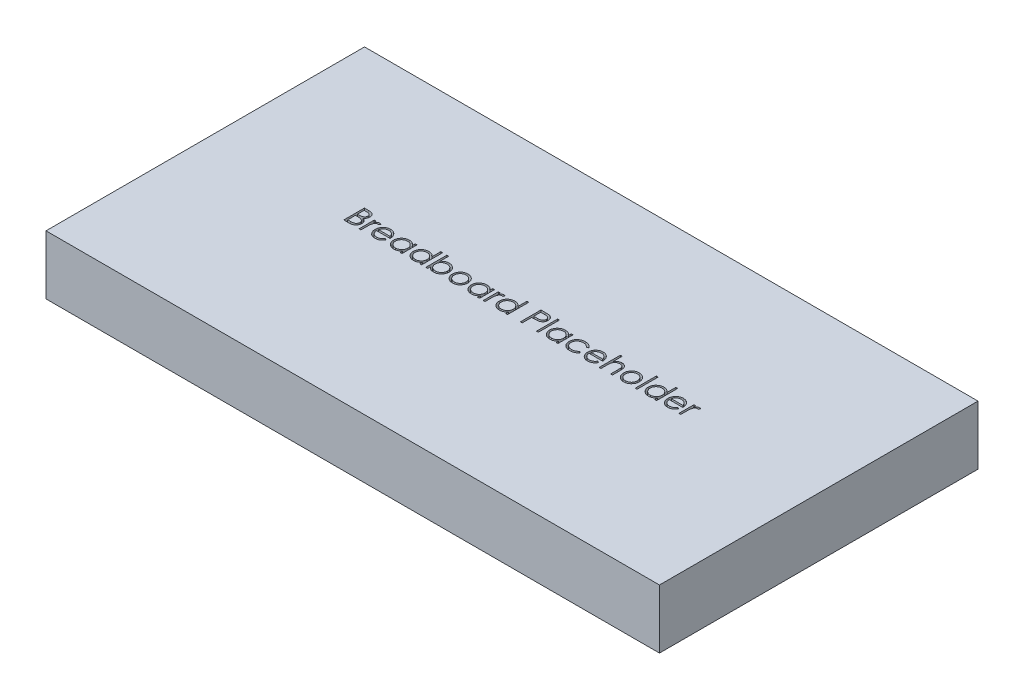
from build123d import *

# Parameters (mm, degrees)
SKETCH1_W           = 104
SKETCH1_H           = 54
BOSS_EXTRUDE1_DEPTH = 10
SKETCH2_W           = 0.314102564
SKETCH2_H           = 3.58974359
CUT_EXTRUDE1_DEPTH  = 2


with BuildPart() as part:
    # Sketch1 → Boss-Extrude1 (new body)
    with BuildSketch(Plane(origin=(0, 0, 0), x_dir=(1, 0, 0), z_dir=(0, 1, 0))):
        Rectangle(SKETCH1_W, SKETCH1_H)
    extrude(amount=BOSS_EXTRUDE1_DEPTH)

    # Sketch2 → Cut-Extrude1 (cut)
    # profile 1 of 21: a face of its own
    with BuildSketch(Plane(origin=(0, 10, 0), x_dir=(1, 0, 0), z_dir=(0, 1, 0))):
        with BuildLine():
            Line((-28.35392761, 3.331891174), (-27.671034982, 3.331891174))
            add(Edge.make_bspline(
                [(-27.671034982, 3.331891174), (-27.637606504, 3.331715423), (-27.572813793, 3.331374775), (-27.478594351, 3.326091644), (-27.390345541, 3.318887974), (-27.308041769, 3.307457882), (-27.231721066, 3.293666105), (-27.161153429, 3.276964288), (-27.096563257, 3.256937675), (-27.01945052, 3.225091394), (-26.931529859, 3.177768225), (-26.836331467, 3.10783966), (-26.754927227, 3.022307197), (-26.68474091, 2.925824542), (-26.62893979, 2.81968877), (-26.588570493, 2.706429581), (-26.563012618, 2.587507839), (-26.560384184, 2.505864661), (-26.559055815, 2.464603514)],
                knots=[0, 0, 0, 0, 1.001505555, 1.941167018, 2.826882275, 3.653841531, 4.429895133, 5.150066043, 5.825578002, 6.45369114, 7.647487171, 8.808567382, 9.977351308, 11.170798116, 12.373658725, 13.556498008, 14.765093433, 16, 16, 16, 16], degree=3))
            add(Edge.make_bspline(
                [(-26.559055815, 2.464603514), (-26.560149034, 2.425950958), (-26.562297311, 2.349995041), (-26.58284007, 2.238900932), (-26.615000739, 2.133149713), (-26.659705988, 2.033127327), (-26.717807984, 1.941093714), (-26.786666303, 1.856306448), (-26.869743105, 1.782355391), (-26.931986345, 1.741012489), (-26.963603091, 1.720012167)],
                knots=[0, 0, 0, 0, 1.044552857, 2.05264487, 3.044412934, 4.028983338, 5.005914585, 5.980388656, 6.974128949, 8, 8, 8, 8], degree=3))
            add(Edge.make_bspline(
                [(-26.963603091, 1.720012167), (-26.923842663, 1.704747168), (-26.847771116, 1.675541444), (-26.743085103, 1.62390598), (-26.652890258, 1.56774387), (-26.576493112, 1.50641202), (-26.511155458, 1.440303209), (-26.454102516, 1.368448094), (-26.405421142, 1.289909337), (-26.363708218, 1.205505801), (-26.331159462, 1.116099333), (-26.306783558, 1.022528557), (-26.292816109, 0.925129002), (-26.290828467, 0.858843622), (-26.289825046, 0.825380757)],
                knots=[0, 0, 0, 0, 1.27268992, 2.434971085, 3.483601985, 4.442670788, 5.356604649, 6.2567628, 7.179492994, 8.113709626, 9.066344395, 10.018646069, 10.999752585, 12, 12, 12, 12], degree=3))
            add(Edge.make_bspline(
                [(-26.289825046, 0.825380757), (-26.290801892, 0.791213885), (-26.292723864, 0.723989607), (-26.306903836, 0.625234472), (-26.330912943, 0.530859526), (-26.363984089, 0.440254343), (-26.407146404, 0.353594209), (-26.459674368, 0.270780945), (-26.522305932, 0.192646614), (-26.592368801, 0.118322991), (-26.671630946, 0.051495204), (-26.757146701, -0.008020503), (-26.849993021, -0.056966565), (-26.948645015, -0.098082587), (-27.054209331, -0.129489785), (-27.166211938, -0.151462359), (-27.28455624, -0.166267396), (-27.365765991, -0.167484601), (-27.407413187, -0.168108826)],
                knots=[0, 0, 0, 0, 0.978564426, 1.925352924, 2.850884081, 3.763762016, 4.682927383, 5.618979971, 6.567305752, 7.547517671, 8.540179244, 9.531824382, 10.526200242, 11.540722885, 12.589160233, 13.674978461, 14.80764778, 16, 16, 16, 16], degree=3))
            Line((-27.407413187, -0.168108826), (-28.35392761, -0.168108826))
            Line((-28.35392761, -0.168108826), (-28.35392761, 3.331891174))
        make_face()
        with BuildLine():
            Line((-28.039825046, 2.972916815), (-28.039825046, 1.851121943))
            Line((-28.039825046, 1.851121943), (-27.828787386, 1.851121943))
            add(Edge.make_bspline(
                [(-27.828787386, 1.851121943), (-27.79793859, 1.851521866), (-27.738332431, 1.852294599), (-27.652012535, 1.854508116), (-27.571887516, 1.860706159), (-27.498095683, 1.866902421), (-27.430753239, 1.876977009), (-27.370009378, 1.888969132), (-27.314910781, 1.901652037), (-27.251371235, 1.923221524), (-27.179298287, 1.955099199), (-27.102465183, 2.004571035), (-27.034730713, 2.063495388), (-26.977533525, 2.13148635), (-26.930722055, 2.206352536), (-26.89820834, 2.286899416), (-26.876161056, 2.371119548), (-26.874169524, 2.428937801), (-26.873158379, 2.458293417)],
                knots=[0, 0, 0, 0, 1.156816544, 2.235205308, 3.236616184, 4.169592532, 5.011045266, 5.787822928, 6.49130361, 7.128639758, 8.301311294, 9.436451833, 10.541879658, 11.654887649, 12.756523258, 13.837046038, 14.901820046, 16, 16, 16, 16], degree=3))
            add(Edge.make_bspline(
                [(-26.873158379, 2.458293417), (-26.873684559, 2.477719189), (-26.874716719, 2.515824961), (-26.883170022, 2.571374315), (-26.897537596, 2.623618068), (-26.91599189, 2.673272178), (-26.941780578, 2.718784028), (-26.972144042, 2.761727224), (-27.008829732, 2.800639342), (-27.050587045, 2.837008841), (-27.098595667, 2.869253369), (-27.152826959, 2.897494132), (-27.214014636, 2.920234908), (-27.281127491, 2.940151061), (-27.355198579, 2.954139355), (-27.435373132, 2.965792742), (-27.522307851, 2.971725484), (-27.582452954, 2.972510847), (-27.613542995, 2.972916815)],
                knots=[0, 0, 0, 0, 0.91205012, 1.789085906, 2.630437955, 3.453916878, 4.269457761, 5.079663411, 5.91843418, 6.774407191, 7.675494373, 8.627863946, 9.638891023, 10.736472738, 11.911756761, 13.175263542, 14.539845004, 16, 16, 16, 16], degree=3))
            Line((-27.613542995, 2.972916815), (-28.039825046, 2.972916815))
        make_face(mode=Mode.SUBTRACT)
        with BuildLine():
            Line((-28.039825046, 1.492147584), (-28.039825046, 0.190865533))
            Line((-28.039825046, 0.190865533), (-27.592509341, 0.190865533))
            add(Edge.make_bspline(
                [(-27.592509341, 0.190865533), (-27.560490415, 0.19124928), (-27.498778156, 0.191988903), (-27.409676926, 0.194403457), (-27.327093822, 0.199895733), (-27.251405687, 0.208541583), (-27.181795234, 0.217920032), (-27.119097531, 0.230531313), (-27.062804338, 0.244980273), (-26.99753003, 0.267314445), (-26.924026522, 0.302010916), (-26.844815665, 0.354325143), (-26.774389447, 0.416648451), (-26.714584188, 0.488779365), (-26.665571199, 0.567210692), (-26.629915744, 0.650356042), (-26.607924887, 0.736841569), (-26.605262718, 0.795808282), (-26.60392761, 0.825380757)],
                knots=[0, 0, 0, 0, 1.160039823, 2.235823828, 3.228722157, 4.157150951, 4.99529583, 5.772374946, 6.472645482, 7.099169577, 8.269452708, 9.405989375, 10.527446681, 11.663510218, 12.788923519, 13.866172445, 14.929861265, 16, 16, 16, 16], degree=3))
            add(Edge.make_bspline(
                [(-26.60392761, 0.825380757), (-26.604203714, 0.843874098), (-26.604751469, 0.880562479), (-26.613012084, 0.934478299), (-26.625025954, 0.986704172), (-26.640557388, 1.037381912), (-26.663176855, 1.085595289), (-26.6895834, 1.132297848), (-26.720544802, 1.177551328), (-26.768788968, 1.234763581), (-26.838960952, 1.300680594), (-26.938667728, 1.365218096), (-27.052040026, 1.417265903), (-27.134267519, 1.43936538), (-27.176744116, 1.450781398)],
                knots=[0, 0, 0, 0, 0.723448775, 1.435228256, 2.130040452, 2.821711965, 3.505591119, 4.210454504, 4.921174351, 5.648778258, 7.137944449, 8.670945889, 10.280296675, 12, 12, 12, 12], degree=3))
            add(Edge.make_bspline(
                [(-27.176744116, 1.450781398), (-27.193773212, 1.454236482), (-27.230695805, 1.461727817), (-27.290903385, 1.46963552), (-27.359639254, 1.47668058), (-27.437062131, 1.481891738), (-27.523269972, 1.487278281), (-27.618446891, 1.489373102), (-27.722204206, 1.491872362), (-27.794196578, 1.492053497), (-27.831591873, 1.492147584)],
                knots=[0, 0, 0, 0, 0.634451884, 1.375622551, 2.216452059, 3.157844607, 4.20941857, 5.370758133, 6.634282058, 8, 8, 8, 8], degree=3))
            Line((-27.831591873, 1.492147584), (-28.039825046, 1.492147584))
        make_face(mode=Mode.SUBTRACT)
    # profile 2 of 21: a face of its own
    with BuildSketch(Plane(origin=(0, 10, 0), x_dir=(1, 0, 0), z_dir=(0, 1, 0))):
        with BuildLine():
            Line((-25.751363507, 2.389583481), (-25.437260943, 2.389583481))
            Line((-25.437260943, 2.389583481), (-25.437260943, 2.013081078))
            add(Edge.make_bspline(
                [(-25.437260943, 2.013081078), (-25.414072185, 2.048136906), (-25.369723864, 2.115180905), (-25.296010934, 2.203850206), (-25.220507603, 2.277265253), (-25.142852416, 2.335768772), (-25.062474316, 2.37958189), (-24.981137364, 2.411674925), (-24.897561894, 2.430652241), (-24.84139997, 2.4331859), (-24.813262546, 2.434455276)],
                knots=[0, 0, 0, 0, 1.2804753, 2.448899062, 3.506932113, 4.484331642, 5.4025378, 6.288909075, 7.142734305, 8, 8, 8, 8], degree=3))
            add(Edge.make_bspline(
                [(-24.813262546, 2.434455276), (-24.791436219, 2.43326475), (-24.746527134, 2.430815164), (-24.678544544, 2.413604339), (-24.608501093, 2.386126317), (-24.563358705, 2.360286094), (-24.539825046, 2.346815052)],
                knots=[0, 0, 0, 0, 0.901110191, 1.854092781, 2.881294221, 4, 4, 4, 4], degree=3))
            Line((-24.539825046, 2.346815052), (-24.712301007, 2.074779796))
            add(Edge.make_bspline(
                [(-24.712301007, 2.074779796), (-24.727410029, 2.081520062), (-24.756089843, 2.094314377), (-24.798044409, 2.109456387), (-24.836725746, 2.118372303), (-24.861369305, 2.119723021), (-24.872857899, 2.120352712)],
                knots=[0, 0, 0, 0, 1.180555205, 2.24091978, 3.179933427, 4, 4, 4, 4], degree=3))
            add(Edge.make_bspline(
                [(-24.872857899, 2.120352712), (-24.898063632, 2.118672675), (-24.949476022, 2.115245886), (-25.024960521, 2.088307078), (-25.098207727, 2.044781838), (-25.156379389, 1.996510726), (-25.201421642, 1.949962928), (-25.233561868, 1.909314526), (-25.263044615, 1.863735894), (-25.291214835, 1.814006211), (-25.316881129, 1.759276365), (-25.340835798, 1.700093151), (-25.362494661, 1.636388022), (-25.374844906, 1.592005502), (-25.3811712, 1.569270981)],
                knots=[0, 0, 0, 0, 1.125678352, 2.296057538, 3.5422874, 4.923748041, 5.663163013, 6.437101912, 7.23742474, 8.08941207, 8.991984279, 9.93940061, 10.944477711, 12, 12, 12, 12], degree=3))
            add(Edge.make_bspline(
                [(-25.3811712, 1.569270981), (-25.385903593, 1.548993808), (-25.396385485, 1.504081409), (-25.406577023, 1.428732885), (-25.416646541, 1.339709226), (-25.423743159, 1.236762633), (-25.430321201, 1.120150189), (-25.434031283, 0.989694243), (-25.437134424, 0.845260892), (-25.437217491, 0.744286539), (-25.437260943, 0.691466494)],
                knots=[0, 0, 0, 0, 0.566838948, 1.255505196, 2.06880316, 3.007127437, 4.065329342, 5.249902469, 6.561414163, 8, 8, 8, 8], degree=3))
            Line((-25.437260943, 0.691466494), (-25.437260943, -0.168108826))
            Line((-25.437260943, -0.168108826), (-25.751363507, -0.168108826))
            Line((-25.751363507, -0.168108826), (-25.751363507, 2.389583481))
        make_face()
    # profile 3 of 21: a face of its own
    with BuildSketch(Plane(origin=(0, 10, 0), x_dir=(1, 0, 0), z_dir=(0, 1, 0))):
        with BuildLine():
            Line((-22.126563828, 0.639583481), (-21.847517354, 0.493049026))
            add(Edge.make_bspline(
                [(-21.847517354, 0.493049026), (-21.869753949, 0.453605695), (-21.913017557, 0.376864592), (-21.987418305, 0.271432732), (-22.065410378, 0.176585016), (-22.150514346, 0.094855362), (-22.240184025, 0.023603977), (-22.33491668, -0.038733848), (-22.435205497, -0.091852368), (-22.541055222, -0.136604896), (-22.653354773, -0.17101439), (-22.77237629, -0.195318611), (-22.898347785, -0.21034188), (-22.984693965, -0.212087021), (-23.028907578, -0.212980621)],
                knots=[0, 0, 0, 0, 1.120438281, 2.179929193, 3.190490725, 4.156257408, 5.095198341, 6.022838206, 6.959905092, 7.901321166, 8.864066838, 9.862729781, 10.905609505, 12, 12, 12, 12], degree=3))
            add(Edge.make_bspline(
                [(-23.028907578, -0.212980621), (-23.078049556, -0.211833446), (-23.173911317, -0.209595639), (-23.313451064, -0.190303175), (-23.444830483, -0.158830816), (-23.568042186, -0.114865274), (-23.682784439, -0.05743795), (-23.789285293, 0.012521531), (-23.888104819, 0.094653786), (-23.976129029, 0.18967023), (-24.055372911, 0.291352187), (-24.125298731, 0.397308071), (-24.183756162, 0.507271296), (-24.231308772, 0.62054182), (-24.269713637, 0.736405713), (-24.296480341, 0.855917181), (-24.311910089, 0.978752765), (-24.314274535, 1.061850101), (-24.315466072, 1.10372611)],
                knots=[0, 0, 0, 0, 1.145258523, 2.234067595, 3.276747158, 4.290159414, 5.277019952, 6.260822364, 7.254936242, 8.264827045, 9.274100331, 10.257902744, 11.220704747, 12.172965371, 13.118907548, 14.062713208, 15.023725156, 16, 16, 16, 16], degree=3))
            add(Edge.make_bspline(
                [(-24.315466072, 1.10372611), (-24.31440693, 1.14302094), (-24.312307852, 1.220898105), (-24.299077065, 1.336163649), (-24.275628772, 1.448192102), (-24.243452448, 1.55707655), (-24.201901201, 1.662634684), (-24.151068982, 1.764930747), (-24.090876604, 1.863855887), (-24.044403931, 1.926259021), (-24.020994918, 1.957692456)],
                knots=[0, 0, 0, 0, 1.024358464, 2.0301432, 3.019427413, 4.004406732, 4.986367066, 5.972626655, 6.978780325, 8, 8, 8, 8], degree=3))
            add(Edge.make_bspline(
                [(-24.020994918, 1.957692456), (-23.989287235, 1.995561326), (-23.926876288, 2.070099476), (-23.821319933, 2.168037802), (-23.707019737, 2.250081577), (-23.585408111, 2.318088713), (-23.455071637, 2.36976236), (-23.317762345, 2.408269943), (-23.171916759, 2.429847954), (-23.072211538, 2.432895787), (-23.021195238, 2.434455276)],
                knots=[0, 0, 0, 0, 1.030682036, 2.02871468, 2.997146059, 3.962720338, 4.930598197, 5.918074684, 6.934738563, 8, 8, 8, 8], degree=3))
            add(Edge.make_bspline(
                [(-23.021195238, 2.434455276), (-22.968747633, 2.433101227), (-22.865857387, 2.430444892), (-22.715825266, 2.405818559), (-22.573864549, 2.366766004), (-22.440032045, 2.311612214), (-22.314314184, 2.240452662), (-22.197528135, 2.15231082), (-22.087676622, 2.049892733), (-22.023768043, 1.971129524), (-21.991247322, 1.931049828)],
                knots=[0, 0, 0, 0, 1.056321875, 2.072262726, 3.055038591, 4.01806755, 4.982017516, 5.957941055, 6.960871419, 8, 8, 8, 8], degree=3))
            add(Edge.make_bspline(
                [(-21.991247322, 1.931049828), (-21.969120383, 1.900846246), (-21.92501379, 1.840640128), (-21.86976669, 1.74246897), (-21.821809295, 1.639758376), (-21.783476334, 1.530848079), (-21.752436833, 1.417028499), (-21.729980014, 1.297485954), (-21.716810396, 1.172256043), (-21.714221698, 1.086929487), (-21.712901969, 1.043429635)],
                knots=[0, 0, 0, 0, 0.94817472, 1.890038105, 2.849395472, 3.817997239, 4.812318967, 5.836947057, 6.897266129, 8, 8, 8, 8], degree=3))
            Line((-21.712901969, 1.043429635), (-24.001363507, 1.043429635))
            add(Edge.make_bspline(
                [(-24.001363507, 1.043429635), (-23.999823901, 1.009729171), (-23.996796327, 0.943458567), (-23.982681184, 0.846487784), (-23.96043241, 0.754114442), (-23.929163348, 0.6670314), (-23.891296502, 0.584101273), (-23.844910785, 0.505939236), (-23.789571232, 0.432901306), (-23.727845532, 0.364334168), (-23.659138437, 0.303273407), (-23.58685569, 0.248621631), (-23.509962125, 0.202816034), (-23.429064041, 0.165636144), (-23.344292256, 0.136529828), (-23.255620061, 0.116662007), (-23.163221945, 0.1033549), (-23.10023621, 0.101875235), (-23.068170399, 0.101121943)],
                knots=[0, 0, 0, 0, 1.094153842, 2.151609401, 3.174256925, 4.172055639, 5.149267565, 6.128595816, 7.11444997, 8.118368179, 9.117203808, 10.09244225, 11.054858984, 12.015122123, 12.976791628, 13.957293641, 14.960065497, 16, 16, 16, 16], degree=3))
            add(Edge.make_bspline(
                [(-23.068170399, 0.101121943), (-23.036819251, 0.10173), (-22.97461256, 0.102936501), (-22.881971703, 0.114668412), (-22.790832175, 0.133638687), (-22.701571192, 0.159528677), (-22.616000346, 0.191105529), (-22.536754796, 0.229208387), (-22.46387458, 0.271358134), (-22.395757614, 0.319567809), (-22.32968662, 0.378575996), (-22.264144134, 0.452211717), (-22.193867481, 0.539299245), (-22.149877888, 0.604844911), (-22.126563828, 0.639583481)],
                knots=[0, 0, 0, 0, 0.99110716, 1.966546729, 2.947904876, 3.932708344, 4.903319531, 5.828989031, 6.710028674, 7.56322171, 8.463672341, 9.504779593, 10.677557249, 12, 12, 12, 12], degree=3))
        make_face()
        with BuildLine():
            add(Edge.make_bspline(
                [(-22.027004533, 1.357532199), (-22.038501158, 1.399195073), (-22.060628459, 1.479382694), (-22.106864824, 1.590423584), (-22.158936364, 1.689111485), (-22.220558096, 1.774691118), (-22.290376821, 1.850694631), (-22.371022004, 1.917113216), (-22.461457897, 1.976530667), (-22.561217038, 2.026683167), (-22.666858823, 2.069373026), (-22.777465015, 2.097998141), (-22.890322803, 2.117607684), (-22.966657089, 2.119433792), (-23.005069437, 2.120352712)],
                knots=[0, 0, 0, 0, 1.154881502, 2.222775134, 3.210006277, 4.132804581, 5.035138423, 5.962687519, 6.919655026, 7.923214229, 8.944639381, 9.960483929, 10.97369054, 12, 12, 12, 12], degree=3))
            add(Edge.make_bspline(
                [(-23.005069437, 2.120352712), (-23.036418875, 2.119741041), (-23.098390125, 2.118531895), (-23.189691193, 2.107061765), (-23.277370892, 2.08810192), (-23.362076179, 2.062136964), (-23.442697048, 2.027528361), (-23.520891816, 1.986945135), (-23.594672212, 1.937403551), (-23.640813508, 1.899644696), (-23.664123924, 1.880569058)],
                knots=[0, 0, 0, 0, 1.04873581, 2.073130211, 3.073294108, 4.04793562, 5.032784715, 6.005352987, 6.992311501, 8, 8, 8, 8], degree=3))
            add(Edge.make_bspline(
                [(-23.664123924, 1.880569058), (-23.680817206, 1.865474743), (-23.71460034, 1.834927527), (-23.759740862, 1.78229832), (-23.802961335, 1.725546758), (-23.842294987, 1.662501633), (-23.878372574, 1.593880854), (-23.912132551, 1.520263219), (-23.942518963, 1.441090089), (-23.959615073, 1.38591765), (-23.968410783, 1.357532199)],
                knots=[0, 0, 0, 0, 0.879870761, 1.780643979, 2.707998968, 3.669668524, 4.684282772, 5.740141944, 6.837334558, 8, 8, 8, 8], degree=3))
            Line((-23.968410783, 1.357532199), (-22.027004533, 1.357532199))
        make_face(mode=Mode.SUBTRACT)
    # profile 4 of 21: a face of its own
    with BuildSketch(Plane(origin=(0, 10, 0), x_dir=(1, 0, 0), z_dir=(0, 1, 0))):
        with BuildLine():
            Line((-18.482132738, 2.389583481), (-18.482132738, -0.168108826))
            Line((-18.482132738, -0.168108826), (-18.796235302, -0.168108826))
            Line((-18.796235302, -0.168108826), (-18.796235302, 0.274299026))
            add(Edge.make_bspline(
                [(-18.796235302, 0.274299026), (-18.831654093, 0.234259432), (-18.900774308, 0.156121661), (-19.016215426, 0.054039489), (-19.138583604, -0.030338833), (-19.267284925, -0.098488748), (-19.402203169, -0.149680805), (-19.543039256, -0.186066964), (-19.689850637, -0.209460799), (-19.790102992, -0.211796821), (-19.840906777, -0.212980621)],
                knots=[0, 0, 0, 0, 1.074387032, 2.096679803, 3.090159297, 4.057316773, 5.018401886, 5.985159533, 6.978961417, 8, 8, 8, 8], degree=3))
            add(Edge.make_bspline(
                [(-19.840906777, -0.212980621), (-19.886074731, -0.211754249), (-19.975147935, -0.209335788), (-20.106177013, -0.190573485), (-20.232269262, -0.160442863), (-20.353543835, -0.118541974), (-20.46921598, -0.062961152), (-20.580276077, 0.003580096), (-20.686148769, 0.082820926), (-20.785220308, 0.173408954), (-20.876452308, 0.271803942), (-20.956513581, 0.376749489), (-21.023266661, 0.487791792), (-21.079086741, 0.603524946), (-21.122083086, 0.724839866), (-21.15205672, 0.851317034), (-21.170797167, 0.982806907), (-21.173214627, 1.07234643), (-21.174440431, 1.117748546)],
                knots=[0, 0, 0, 0, 1.033919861, 2.038935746, 3.024066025, 3.998881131, 4.97069526, 5.957263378, 6.95902576, 7.993208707, 9.027059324, 10.027763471, 11.009749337, 11.988697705, 12.965288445, 13.950418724, 14.960734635, 16, 16, 16, 16], degree=3))
            add(Edge.make_bspline(
                [(-21.174440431, 1.117748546), (-21.173187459, 1.162212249), (-21.170710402, 1.250114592), (-21.152257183, 1.37939329), (-21.121226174, 1.503911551), (-21.077678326, 1.623268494), (-21.021836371, 1.737608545), (-20.953908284, 1.84701257), (-20.873889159, 1.951781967), (-20.781636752, 2.049453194), (-20.681701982, 2.139673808), (-20.574793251, 2.218082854), (-20.46356997, 2.285799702), (-20.34630696, 2.339453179), (-20.224739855, 2.382862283), (-20.097786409, 2.412895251), (-19.96597483, 2.430592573), (-19.876484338, 2.433155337), (-19.831091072, 2.434455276)],
                knots=[0, 0, 0, 0, 1.020392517, 2.01726096, 2.990465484, 3.961182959, 4.928053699, 5.906110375, 6.912531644, 7.948652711, 8.985773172, 9.998621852, 10.987621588, 11.969261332, 12.953316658, 13.946091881, 14.958173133, 16, 16, 16, 16], degree=3))
            add(Edge.make_bspline(
                [(-19.831091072, 2.434455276), (-19.778891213, 2.433017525), (-19.676529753, 2.430198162), (-19.526801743, 2.406735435), (-19.385157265, 2.367096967), (-19.250502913, 2.313179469), (-19.123322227, 2.24153074), (-19.004819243, 2.151150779), (-18.89375376, 2.042609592), (-18.829373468, 1.959239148), (-18.796235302, 1.91632627)],
                knots=[0, 0, 0, 0, 1.038897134, 2.037228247, 3.008116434, 3.962042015, 4.918381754, 5.904844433, 6.921570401, 8, 8, 8, 8], degree=3))
            Line((-18.796235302, 1.91632627), (-18.796235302, 2.389583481))
            Line((-18.796235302, 2.389583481), (-18.482132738, 2.389583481))
        make_face()
        with BuildLine():
            add(Edge.make_bspline(
                [(-19.826884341, 2.120352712), (-19.872798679, 2.118719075), (-19.963426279, 2.115494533), (-20.096470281, 2.090321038), (-20.223783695, 2.048436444), (-20.344729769, 1.991154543), (-20.457397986, 1.919125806), (-20.558091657, 1.832004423), (-20.647634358, 1.732167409), (-20.722942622, 1.620065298), (-20.784333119, 1.499887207), (-20.827500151, 1.374262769), (-20.855969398, 1.245457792), (-20.858877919, 1.158095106), (-20.860337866, 1.114242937)],
                knots=[0, 0, 0, 0, 1.031046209, 2.035121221, 3.029706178, 4.034933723, 5.034054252, 6.02443088, 7.017295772, 8.038157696, 9.050218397, 10.03989886, 11.016116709, 12, 12, 12, 12], degree=3))
            add(Edge.make_bspline(
                [(-20.860337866, 1.114242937), (-20.858472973, 1.070652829), (-20.854750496, 0.983643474), (-20.827999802, 0.854662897), (-20.783119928, 0.729008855), (-20.721877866, 0.607747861), (-20.645191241, 0.495163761), (-20.556302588, 0.393423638), (-20.454352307, 0.30593405), (-20.3414248, 0.232696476), (-20.22081683, 0.173533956), (-20.093982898, 0.132368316), (-19.96330726, 0.105790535), (-19.874454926, 0.102686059), (-19.829688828, 0.101121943)],
                knots=[0, 0, 0, 0, 0.979072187, 1.954306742, 2.945804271, 3.96968567, 4.997920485, 5.998718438, 6.996577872, 8.005894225, 9.015743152, 10.005417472, 10.995077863, 12, 12, 12, 12], degree=3))
            add(Edge.make_bspline(
                [(-19.829688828, 0.101121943), (-19.784242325, 0.102781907), (-19.693853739, 0.106083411), (-19.560415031, 0.131364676), (-19.430920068, 0.173133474), (-19.30713284, 0.231032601), (-19.191816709, 0.302789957), (-19.088318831, 0.386797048), (-19.000802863, 0.484500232), (-18.926610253, 0.591876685), (-18.868434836, 0.709588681), (-18.826058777, 0.834922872), (-18.801004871, 0.96788362), (-18.797847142, 1.058747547), (-18.796235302, 1.105128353)],
                knots=[0, 0, 0, 0, 1.01762866, 2.023962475, 3.030623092, 4.058876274, 5.077231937, 6.066672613, 7.034107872, 8.005628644, 8.981990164, 9.965428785, 10.961468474, 12, 12, 12, 12], degree=3))
            add(Edge.make_bspline(
                [(-18.796235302, 1.105128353), (-18.797194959, 1.140466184), (-18.799083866, 1.210022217), (-18.813514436, 1.312149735), (-18.836469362, 1.409883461), (-18.868815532, 1.50332615), (-18.911306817, 1.591961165), (-18.962554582, 1.676424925), (-19.023460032, 1.756278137), (-19.093042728, 1.830421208), (-19.169207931, 1.89804767), (-19.249802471, 1.958411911), (-19.335781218, 2.008000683), (-19.425698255, 2.049041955), (-19.51970959, 2.081701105), (-19.61858021, 2.103488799), (-19.721259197, 2.11844912), (-19.791305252, 2.1197115), (-19.826884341, 2.120352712)],
                knots=[0, 0, 0, 0, 1.050140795, 2.067009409, 3.05949893, 4.030605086, 5.00011959, 5.97591094, 6.962425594, 7.979863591, 8.993523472, 9.986985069, 10.967611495, 11.937549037, 12.921786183, 13.919465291, 14.943216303, 16, 16, 16, 16], degree=3))
        make_face(mode=Mode.SUBTRACT)
    # profile 5 of 21: a face of its own
    with BuildSketch(Plane(origin=(0, 10, 0), x_dir=(1, 0, 0), z_dir=(0, 1, 0))):
        with BuildLine():
            Line((-15.161619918, 3.421634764), (-15.161619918, -0.168108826))
            Line((-15.161619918, -0.168108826), (-15.475722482, -0.168108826))
            Line((-15.475722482, -0.168108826), (-15.475722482, 0.274299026))
            add(Edge.make_bspline(
                [(-15.475722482, 0.274299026), (-15.511141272, 0.234259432), (-15.580261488, 0.156121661), (-15.695702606, 0.054039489), (-15.818070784, -0.030338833), (-15.946772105, -0.098488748), (-16.081690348, -0.149680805), (-16.222526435, -0.186066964), (-16.369337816, -0.209460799), (-16.469590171, -0.211796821), (-16.520393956, -0.212980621)],
                knots=[0, 0, 0, 0, 1.074387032, 2.096679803, 3.090159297, 4.057316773, 5.018401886, 5.985159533, 6.978961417, 8, 8, 8, 8], degree=3))
            add(Edge.make_bspline(
                [(-16.520393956, -0.212980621), (-16.56556191, -0.211754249), (-16.654635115, -0.209335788), (-16.785664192, -0.190573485), (-16.911756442, -0.160442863), (-17.033031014, -0.118541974), (-17.14870316, -0.062961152), (-17.259763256, 0.003580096), (-17.365635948, 0.082820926), (-17.464707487, 0.173408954), (-17.555939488, 0.271803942), (-17.63600076, 0.376749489), (-17.70275384, 0.487791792), (-17.758573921, 0.603524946), (-17.801570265, 0.724839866), (-17.8315439, 0.851317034), (-17.850284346, 0.982806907), (-17.852701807, 1.07234643), (-17.85392761, 1.117748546)],
                knots=[0, 0, 0, 0, 1.033919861, 2.038935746, 3.024066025, 3.998881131, 4.97069526, 5.957263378, 6.95902576, 7.993208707, 9.027059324, 10.027763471, 11.009749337, 11.988697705, 12.965288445, 13.950418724, 14.960734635, 16, 16, 16, 16], degree=3))
            add(Edge.make_bspline(
                [(-17.85392761, 1.117748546), (-17.852674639, 1.162212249), (-17.850197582, 1.250114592), (-17.831744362, 1.37939329), (-17.800713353, 1.503911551), (-17.757165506, 1.623268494), (-17.701323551, 1.737608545), (-17.633395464, 1.84701257), (-17.553376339, 1.951781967), (-17.461123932, 2.049453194), (-17.361189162, 2.139673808), (-17.254280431, 2.218082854), (-17.14305715, 2.285799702), (-17.025794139, 2.339453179), (-16.904227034, 2.382862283), (-16.777273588, 2.412895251), (-16.64546201, 2.430592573), (-16.555971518, 2.433155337), (-16.510578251, 2.434455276)],
                knots=[0, 0, 0, 0, 1.020392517, 2.01726096, 2.990465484, 3.961182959, 4.928053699, 5.906110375, 6.912531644, 7.948652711, 8.985773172, 9.998621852, 10.987621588, 11.969261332, 12.953316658, 13.946091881, 14.958173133, 16, 16, 16, 16], degree=3))
            add(Edge.make_bspline(
                [(-16.510578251, 2.434455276), (-16.458361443, 2.43288818), (-16.355865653, 2.429812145), (-16.205967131, 2.404105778), (-16.064179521, 2.3609429), (-15.929686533, 2.301851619), (-15.803289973, 2.225050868), (-15.684063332, 2.13229942), (-15.574080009, 2.020972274), (-15.509008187, 1.9373607), (-15.475722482, 1.894591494)],
                knots=[0, 0, 0, 0, 1.031072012, 2.023879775, 2.993683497, 3.952812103, 4.918022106, 5.908088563, 6.929940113, 8, 8, 8, 8], degree=3))
            Line((-15.475722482, 1.894591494), (-15.475722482, 3.421634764))
            Line((-15.475722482, 3.421634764), (-15.161619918, 3.421634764))
        make_face()
        with BuildLine():
            add(Edge.make_bspline(
                [(-16.50637152, 2.120352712), (-16.552285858, 2.118719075), (-16.642913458, 2.115494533), (-16.77595746, 2.090321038), (-16.903270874, 2.048436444), (-17.024216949, 1.991154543), (-17.136885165, 1.919125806), (-17.237578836, 1.832004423), (-17.327121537, 1.732167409), (-17.402429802, 1.620065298), (-17.463820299, 1.499887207), (-17.50698733, 1.374262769), (-17.535456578, 1.245457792), (-17.538365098, 1.158095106), (-17.539825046, 1.114242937)],
                knots=[0, 0, 0, 0, 1.031046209, 2.035121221, 3.029706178, 4.034933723, 5.034054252, 6.02443088, 7.017295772, 8.038157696, 9.050218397, 10.03989886, 11.016116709, 12, 12, 12, 12], degree=3))
            add(Edge.make_bspline(
                [(-17.539825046, 1.114242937), (-17.537960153, 1.070652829), (-17.534237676, 0.983643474), (-17.507486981, 0.854662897), (-17.462607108, 0.729008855), (-17.401365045, 0.607747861), (-17.32467842, 0.495163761), (-17.235789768, 0.393423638), (-17.133839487, 0.30593405), (-17.02091198, 0.232696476), (-16.900304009, 0.173533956), (-16.773470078, 0.132368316), (-16.64279444, 0.105790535), (-16.553942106, 0.102686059), (-16.509176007, 0.101121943)],
                knots=[0, 0, 0, 0, 0.979072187, 1.954306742, 2.945804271, 3.96968567, 4.997920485, 5.998718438, 6.996577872, 8.005894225, 9.015743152, 10.005417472, 10.995077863, 12, 12, 12, 12], degree=3))
            add(Edge.make_bspline(
                [(-16.509176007, 0.101121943), (-16.463729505, 0.102781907), (-16.373340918, 0.106083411), (-16.23990221, 0.131364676), (-16.110407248, 0.173133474), (-15.986620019, 0.231032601), (-15.871303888, 0.302789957), (-15.76780601, 0.386797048), (-15.680290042, 0.484500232), (-15.606097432, 0.591876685), (-15.547922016, 0.709588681), (-15.505545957, 0.834922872), (-15.480492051, 0.96788362), (-15.477334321, 1.058747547), (-15.475722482, 1.105128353)],
                knots=[0, 0, 0, 0, 1.01762866, 2.023962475, 3.030623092, 4.058876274, 5.077231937, 6.066672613, 7.034107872, 8.005628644, 8.981990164, 9.965428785, 10.961468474, 12, 12, 12, 12], degree=3))
            add(Edge.make_bspline(
                [(-15.475722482, 1.105128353), (-15.476682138, 1.140466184), (-15.478571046, 1.210022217), (-15.493001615, 1.312149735), (-15.515956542, 1.409883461), (-15.548302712, 1.50332615), (-15.590793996, 1.591961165), (-15.642041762, 1.676424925), (-15.702947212, 1.756278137), (-15.772529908, 1.830421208), (-15.84869511, 1.89804767), (-15.929289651, 1.958411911), (-16.015268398, 2.008000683), (-16.105185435, 2.049041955), (-16.199196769, 2.081701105), (-16.298067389, 2.103488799), (-16.400746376, 2.11844912), (-16.470792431, 2.1197115), (-16.50637152, 2.120352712)],
                knots=[0, 0, 0, 0, 1.050140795, 2.067009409, 3.05949893, 4.030605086, 5.00011959, 5.97591094, 6.962425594, 7.979863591, 8.993523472, 9.986985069, 10.967611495, 11.937549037, 12.921786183, 13.919465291, 14.943216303, 16, 16, 16, 16], degree=3))
        make_face(mode=Mode.SUBTRACT)
    # profile 6 of 21: a face of its own
    with BuildSketch(Plane(origin=(0, 10, 0), x_dir=(1, 0, 0), z_dir=(0, 1, 0))):
        with BuildLine():
            Line((-14.4436712, -0.168108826), (-14.4436712, 3.421634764))
            Line((-14.4436712, 3.421634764), (-14.129568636, 3.421634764))
            Line((-14.129568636, 3.421634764), (-14.129568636, 1.925440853))
            add(Edge.make_bspline(
                [(-14.129568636, 1.925440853), (-14.094175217, 1.966198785), (-14.025121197, 2.04571919), (-13.909344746, 2.14956684), (-13.787939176, 2.237619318), (-13.659980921, 2.310205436), (-13.525287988, 2.365479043), (-13.384555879, 2.405901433), (-13.237424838, 2.430288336), (-13.137105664, 2.433054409), (-13.086299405, 2.434455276)],
                knots=[0, 0, 0, 0, 1.077089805, 2.101446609, 3.097517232, 4.067117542, 5.031729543, 5.997785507, 6.985986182, 8, 8, 8, 8], degree=3))
            add(Edge.make_bspline(
                [(-13.086299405, 2.434455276), (-13.041133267, 2.433215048), (-12.951832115, 2.430762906), (-12.820549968, 2.41212841), (-12.694236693, 2.381910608), (-12.572961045, 2.340018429), (-12.457288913, 2.284435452), (-12.346229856, 2.217894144), (-12.240352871, 2.138655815), (-12.141297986, 2.048057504), (-12.050004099, 1.949700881), (-11.970091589, 1.844520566), (-11.902591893, 1.734045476), (-11.8467606, 1.618645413), (-11.803589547, 1.497849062), (-11.77384728, 1.371774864), (-11.754953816, 1.240546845), (-11.75257357, 1.151234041), (-11.751363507, 1.105829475)],
                knots=[0, 0, 0, 0, 1.034377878, 2.045141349, 3.03070803, 4.00595497, 4.978199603, 5.965204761, 6.967410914, 8.002051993, 9.036360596, 10.037508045, 11.022711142, 11.997267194, 12.969246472, 13.954813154, 14.960274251, 16, 16, 16, 16], degree=3))
            add(Edge.make_bspline(
                [(-11.751363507, 1.105829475), (-11.752599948, 1.061129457), (-11.755038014, 0.972988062), (-11.773659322, 0.843281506), (-11.804405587, 0.718442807), (-11.84836677, 0.598794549), (-11.903631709, 0.483774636), (-11.972742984, 0.374694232), (-12.052553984, 0.269655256), (-12.144885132, 0.172031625), (-12.244798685, 0.081798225), (-12.351712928, 0.00339236), (-12.46293485, -0.06432476), (-12.580197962, -0.117980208), (-12.701766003, -0.161381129), (-12.82894139, -0.19149882), (-12.961004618, -0.209071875), (-13.050723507, -0.211667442), (-13.09611511, -0.212980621)],
                knots=[0, 0, 0, 0, 1.024244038, 2.01964794, 2.996620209, 3.965911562, 4.936179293, 5.91563013, 6.920572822, 7.955171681, 8.990768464, 10.002129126, 10.989675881, 11.969873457, 12.952483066, 13.943799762, 14.959703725, 16, 16, 16, 16], degree=3))
            add(Edge.make_bspline(
                [(-13.09611511, -0.212980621), (-13.148080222, -0.211540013), (-13.249974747, -0.208715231), (-13.399027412, -0.185296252), (-13.540108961, -0.145434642), (-13.67482651, -0.091872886), (-13.801254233, -0.019344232), (-13.920194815, 0.070612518), (-14.030898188, 0.179479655), (-14.096115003, 0.262541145), (-14.129568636, 0.305148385)],
                knots=[0, 0, 0, 0, 1.035807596, 2.031038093, 2.998900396, 3.954262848, 4.914341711, 5.895762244, 6.92060972, 8, 8, 8, 8], degree=3))
            Line((-14.129568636, 0.305148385), (-14.129568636, -0.168108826))
            Line((-14.129568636, -0.168108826), (-14.4436712, -0.168108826))
        make_face()
        with BuildLine():
            add(Edge.make_bspline(
                [(-13.098919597, 0.101121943), (-13.053005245, 0.102755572), (-12.962377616, 0.105980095), (-12.829333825, 0.131153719), (-12.702019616, 0.173037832), (-12.581076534, 0.230321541), (-12.468397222, 0.302343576), (-12.367744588, 0.389489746), (-12.278264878, 0.488991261), (-12.203613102, 0.601224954), (-12.141286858, 0.720675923), (-12.098473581, 0.846330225), (-12.06975386, 0.974825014), (-12.066901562, 1.061971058), (-12.065466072, 1.105829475)],
                knots=[0, 0, 0, 0, 1.031910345, 2.036826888, 3.032245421, 4.038315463, 5.03827337, 6.029480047, 7.023177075, 8.037597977, 9.052889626, 10.043399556, 11.015292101, 12, 12, 12, 12], degree=3))
            add(Edge.make_bspline(
                [(-12.065466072, 1.105829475), (-12.067353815, 1.149645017), (-12.071121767, 1.237101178), (-12.097496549, 1.366750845), (-12.143554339, 1.49233847), (-12.204672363, 1.613516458), (-12.280540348, 1.726524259), (-12.369546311, 1.828014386), (-12.471428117, 1.91557437), (-12.584251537, 1.988564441), (-12.704431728, 2.048123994), (-12.830922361, 2.08896902), (-12.961080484, 2.115707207), (-13.049475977, 2.118796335), (-13.094011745, 2.120352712)],
                knots=[0, 0, 0, 0, 0.984795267, 1.965658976, 2.959410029, 3.983795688, 5.009594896, 6.01088574, 7.009236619, 8.019050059, 9.024672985, 10.014834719, 10.999826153, 12, 12, 12, 12], degree=3))
            add(Edge.make_bspline(
                [(-13.094011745, 2.120352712), (-13.139479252, 2.118797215), (-13.229723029, 2.115709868), (-13.362891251, 2.088922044), (-13.492954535, 2.047874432), (-13.617242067, 1.988943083), (-13.733096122, 1.916831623), (-13.836708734, 1.832091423), (-13.926040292, 1.735311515), (-13.999584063, 1.626805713), (-14.057988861, 1.509620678), (-14.09977261, 1.384608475), (-14.124772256, 1.252427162), (-14.127950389, 1.161793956), (-14.129568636, 1.11564518)],
                knots=[0, 0, 0, 0, 1.016820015, 2.018181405, 3.029022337, 4.06341356, 5.088169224, 6.076823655, 7.05054209, 8.02560866, 9.001194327, 9.972267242, 10.967515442, 12, 12, 12, 12], degree=3))
            add(Edge.make_bspline(
                [(-14.129568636, 1.11564518), (-14.128608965, 1.080307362), (-14.12672003, 1.010751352), (-14.112289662, 0.908623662), (-14.089334, 0.810890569), (-14.056990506, 0.717445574), (-14.014489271, 0.628819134), (-13.963279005, 0.544323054), (-13.902327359, 0.464719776), (-13.833420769, 0.390204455), (-13.757458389, 0.322395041), (-13.67593527, 0.263616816), (-13.590517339, 0.213002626), (-13.500227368, 0.172657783), (-13.406116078, 0.139731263), (-13.307217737, 0.117997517), (-13.204546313, 0.103022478), (-13.134499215, 0.101762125), (-13.098919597, 0.101121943)],
                knots=[0, 0, 0, 0, 1.050331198, 2.067384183, 3.060053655, 4.031335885, 5.001026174, 5.976994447, 6.963687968, 7.976578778, 8.990422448, 9.985569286, 10.960374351, 11.936812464, 12.921228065, 13.919088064, 14.943024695, 16, 16, 16, 16], degree=3))
        make_face(mode=Mode.SUBTRACT)
    # profile 7 of 21: a face of its own
    with BuildSketch(Plane(origin=(0, 10, 0), x_dir=(1, 0, 0), z_dir=(0, 1, 0))):
        with BuildLine():
            add(Edge.make_bspline(
                [(-9.887781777, 2.434455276), (-9.839790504, 2.433433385), (-9.745691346, 2.431429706), (-9.60788346, 2.410014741), (-9.476338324, 2.377267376), (-9.350552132, 2.331995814), (-9.232135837, 2.271313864), (-9.119364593, 2.198904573), (-9.012547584, 2.113121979), (-8.948524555, 2.046763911), (-8.916026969, 2.013081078)],
                knots=[0, 0, 0, 0, 1.054011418, 2.066658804, 3.057071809, 4.030435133, 4.997543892, 5.974964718, 6.972108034, 8, 8, 8, 8], degree=3))
            add(Edge.make_bspline(
                [(-8.916026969, 2.013081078), (-8.888045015, 1.980867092), (-8.832622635, 1.91706255), (-8.761556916, 1.813606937), (-8.700335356, 1.706466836), (-8.651272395, 1.594219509), (-8.612587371, 1.477844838), (-8.585121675, 1.356942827), (-8.56878474, 1.23178048), (-8.566581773, 1.146776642), (-8.565466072, 1.10372611)],
                knots=[0, 0, 0, 0, 1.025258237, 2.030674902, 3.01204498, 3.988269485, 4.97094183, 5.956517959, 6.965070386, 8, 8, 8, 8], degree=3))
            add(Edge.make_bspline(
                [(-8.565466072, 1.10372611), (-8.566447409, 1.060426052), (-8.568386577, 0.974863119), (-8.586730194, 0.848843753), (-8.615261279, 0.72664893), (-8.656093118, 0.608790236), (-8.708451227, 0.494907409), (-8.772341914, 0.38549786), (-8.848213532, 0.280345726), (-8.934217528, 0.180343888), (-9.029269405, 0.088177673), (-9.132385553, 0.007849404), (-9.241539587, -0.06097212), (-9.35818294, -0.116408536), (-9.481250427, -0.160118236), (-9.611007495, -0.190818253), (-9.747252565, -0.209379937), (-9.840279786, -0.21176351), (-9.887781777, -0.212980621)],
                knots=[0, 0, 0, 0, 0.998656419, 1.973391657, 2.932242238, 3.890759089, 4.846373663, 5.82037756, 6.809684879, 7.83454468, 8.860553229, 9.859544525, 10.845671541, 11.83227036, 12.833544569, 13.85385346, 14.904124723, 16, 16, 16, 16], degree=3))
            add(Edge.make_bspline(
                [(-9.887781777, -0.212980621), (-9.935516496, -0.211759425), (-10.029007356, -0.20936765), (-10.165733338, -0.190890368), (-10.295722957, -0.160132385), (-10.418951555, -0.116264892), (-10.536096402, -0.060970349), (-10.645882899, 0.007641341), (-10.749082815, 0.088201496), (-10.844154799, 0.180337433), (-10.930153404, 0.28034739), (-11.006026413, 0.385497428), (-11.069916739, 0.494907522), (-11.122274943, 0.608790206), (-11.163106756, 0.726648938), (-11.191637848, 0.848843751), (-11.209981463, 0.974863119), (-11.211920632, 1.060426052), (-11.212901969, 1.10372611)],
                knots=[0, 0, 0, 0, 1.099876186, 2.154163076, 3.173186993, 4.173200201, 5.163417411, 6.152872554, 7.150605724, 8.17532212, 9.198891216, 10.186952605, 11.159729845, 12.11414092, 13.071450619, 14.029093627, 15.002601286, 16, 16, 16, 16], degree=3))
            add(Edge.make_bspline(
                [(-11.212901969, 1.10372611), (-11.211778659, 1.146542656), (-11.209554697, 1.231312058), (-11.193234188, 1.356239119), (-11.165875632, 1.476936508), (-11.127144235, 1.592861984), (-11.077629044, 1.70461742), (-11.017267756, 1.812022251), (-10.945477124, 1.915010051), (-10.890275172, 1.978732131), (-10.862341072, 2.010977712)],
                knots=[0, 0, 0, 0, 1.031353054, 2.041901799, 3.029428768, 4.008703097, 4.981709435, 5.96992636, 6.972712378, 8, 8, 8, 8], degree=3))
            add(Edge.make_bspline(
                [(-10.862341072, 2.010977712), (-10.829892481, 2.044952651), (-10.766076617, 2.111770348), (-10.658727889, 2.197302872), (-10.546234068, 2.271218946), (-10.426509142, 2.330695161), (-10.300826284, 2.377533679), (-10.168607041, 2.410099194), (-10.030331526, 2.431352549), (-9.935771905, 2.433410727), (-9.887781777, 2.434455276)],
                knots=[0, 0, 0, 0, 1.027980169, 2.021703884, 2.998553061, 3.971491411, 4.943284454, 5.930300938, 6.949603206, 8, 8, 8, 8], degree=3))
        make_face()
        with BuildLine():
            add(Edge.make_bspline(
                [(-9.88918402, 2.120352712), (-9.923121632, 2.119388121), (-9.99012076, 2.117483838), (-10.088740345, 2.102999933), (-10.183680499, 2.080052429), (-10.275121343, 2.047448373), (-10.362754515, 2.005349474), (-10.446663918, 1.953641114), (-10.527096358, 1.893008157), (-10.602478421, 1.823545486), (-10.671660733, 1.747666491), (-10.73213871, 1.666818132), (-10.783563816, 1.582311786), (-10.826403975, 1.494059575), (-10.858311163, 1.401167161), (-10.881484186, 1.30468653), (-10.895954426, 1.204421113), (-10.897840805, 1.136260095), (-10.898799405, 1.101622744)],
                knots=[0, 0, 0, 0, 1.021534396, 2.016698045, 2.994645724, 3.958388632, 4.93408049, 5.916473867, 6.921342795, 7.962252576, 8.998418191, 10.008913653, 10.997312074, 11.973003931, 12.956656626, 13.948281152, 14.957379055, 16, 16, 16, 16], degree=3))
            add(Edge.make_bspline(
                [(-10.898799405, 1.101622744), (-10.897192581, 1.056870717), (-10.894003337, 0.968046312), (-10.8680681, 0.837235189), (-10.824681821, 0.711653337), (-10.766094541, 0.592036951), (-10.692688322, 0.481364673), (-10.606201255, 0.382693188), (-10.507561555, 0.297507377), (-10.397945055, 0.226826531), (-10.279590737, 0.170666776), (-10.154334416, 0.1308678), (-10.023693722, 0.104996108), (-9.934412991, 0.102424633), (-9.88918402, 0.101121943)],
                knots=[0, 0, 0, 0, 1.016792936, 2.018143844, 3.017858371, 4.030088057, 5.03801393, 6.028138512, 7.003788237, 7.991172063, 8.984598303, 9.972568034, 10.972917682, 12, 12, 12, 12], degree=3))
            add(Edge.make_bspline(
                [(-9.88918402, 0.101121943), (-9.843957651, 0.102432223), (-9.754682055, 0.10501868), (-9.624222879, 0.1307375), (-9.499308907, 0.170841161), (-9.381077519, 0.22676337), (-9.271510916, 0.297775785), (-9.172161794, 0.382212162), (-9.086413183, 0.481626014), (-9.013079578, 0.592183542), (-8.953532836, 0.711467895), (-8.910349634, 0.837258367), (-8.884352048, 0.968040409), (-8.881171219, 1.05686874), (-8.879568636, 1.101622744)],
                knots=[0, 0, 0, 0, 1.02726834, 2.027799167, 3.010890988, 4.004497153, 4.992059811, 5.971914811, 6.958719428, 7.966827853, 8.981595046, 9.981490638, 10.983022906, 12, 12, 12, 12], degree=3))
            add(Edge.make_bspline(
                [(-8.879568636, 1.101622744), (-8.880526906, 1.136260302), (-8.882412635, 1.204421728), (-8.896887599, 1.304684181), (-8.920043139, 1.401175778), (-8.952014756, 1.494027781), (-8.99466877, 1.582540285), (-9.047085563, 1.666570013), (-9.107316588, 1.747946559), (-9.177333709, 1.823300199), (-9.252637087, 1.893035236), (-9.333102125, 1.953664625), (-9.416887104, 2.005122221), (-9.504265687, 2.047808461), (-9.595718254, 2.079755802), (-9.690525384, 2.103132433), (-9.788724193, 2.11742263), (-9.855483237, 2.119369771), (-9.88918402, 2.120352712)],
                knots=[0, 0, 0, 0, 1.042956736, 2.052379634, 3.044323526, 4.02829302, 5.004299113, 5.996692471, 7.007513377, 8.048758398, 9.090003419, 10.095195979, 11.07790575, 12.047570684, 13.018257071, 13.989683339, 14.985167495, 16, 16, 16, 16], degree=3))
        make_face(mode=Mode.SUBTRACT)
    # profile 8 of 21: a face of its own
    with BuildSketch(Plane(origin=(0, 10, 0), x_dir=(1, 0, 0), z_dir=(0, 1, 0))):
        with BuildLine():
            Line((-5.334696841, 2.389583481), (-5.334696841, -0.168108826))
            Line((-5.334696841, -0.168108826), (-5.648799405, -0.168108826))
            Line((-5.648799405, -0.168108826), (-5.648799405, 0.274299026))
            add(Edge.make_bspline(
                [(-5.648799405, 0.274299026), (-5.684218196, 0.234259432), (-5.753338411, 0.156121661), (-5.868779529, 0.054039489), (-5.991147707, -0.030338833), (-6.119849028, -0.098488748), (-6.254767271, -0.149680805), (-6.395603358, -0.186066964), (-6.542414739, -0.209460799), (-6.642667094, -0.211796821), (-6.693470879, -0.212980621)],
                knots=[0, 0, 0, 0, 1.074387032, 2.096679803, 3.090159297, 4.057316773, 5.018401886, 5.985159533, 6.978961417, 8, 8, 8, 8], degree=3))
            add(Edge.make_bspline(
                [(-6.693470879, -0.212980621), (-6.738638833, -0.211754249), (-6.827712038, -0.209335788), (-6.958741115, -0.190573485), (-7.084833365, -0.160442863), (-7.206107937, -0.118541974), (-7.321780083, -0.062961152), (-7.432840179, 0.003580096), (-7.538712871, 0.082820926), (-7.63778441, 0.173408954), (-7.729016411, 0.271803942), (-7.809077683, 0.376749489), (-7.875830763, 0.487791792), (-7.931650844, 0.603524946), (-7.974647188, 0.724839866), (-8.004620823, 0.851317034), (-8.023361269, 0.982806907), (-8.02577873, 1.07234643), (-8.027004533, 1.117748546)],
                knots=[0, 0, 0, 0, 1.033919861, 2.038935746, 3.024066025, 3.998881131, 4.97069526, 5.957263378, 6.95902576, 7.993208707, 9.027059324, 10.027763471, 11.009749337, 11.988697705, 12.965288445, 13.950418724, 14.960734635, 16, 16, 16, 16], degree=3))
            add(Edge.make_bspline(
                [(-8.027004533, 1.117748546), (-8.025751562, 1.162212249), (-8.023274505, 1.250114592), (-8.004821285, 1.37939329), (-7.973790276, 1.503911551), (-7.930242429, 1.623268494), (-7.874400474, 1.737608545), (-7.806472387, 1.84701257), (-7.726453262, 1.951781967), (-7.634200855, 2.049453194), (-7.534266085, 2.139673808), (-7.427357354, 2.218082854), (-7.316134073, 2.285799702), (-7.198871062, 2.339453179), (-7.077303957, 2.382862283), (-6.950350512, 2.412895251), (-6.818538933, 2.430592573), (-6.729048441, 2.433155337), (-6.683655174, 2.434455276)],
                knots=[0, 0, 0, 0, 1.020392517, 2.01726096, 2.990465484, 3.961182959, 4.928053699, 5.906110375, 6.912531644, 7.948652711, 8.985773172, 9.998621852, 10.987621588, 11.969261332, 12.953316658, 13.946091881, 14.958173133, 16, 16, 16, 16], degree=3))
            add(Edge.make_bspline(
                [(-6.683655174, 2.434455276), (-6.631455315, 2.433017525), (-6.529093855, 2.430198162), (-6.379365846, 2.406735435), (-6.237721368, 2.367096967), (-6.103067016, 2.313179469), (-5.97588633, 2.24153074), (-5.857383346, 2.151150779), (-5.746317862, 2.042609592), (-5.681937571, 1.959239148), (-5.648799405, 1.91632627)],
                knots=[0, 0, 0, 0, 1.038897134, 2.037228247, 3.008116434, 3.962042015, 4.918381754, 5.904844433, 6.921570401, 8, 8, 8, 8], degree=3))
            Line((-5.648799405, 1.91632627), (-5.648799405, 2.389583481))
            Line((-5.648799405, 2.389583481), (-5.334696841, 2.389583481))
        make_face()
        with BuildLine():
            add(Edge.make_bspline(
                [(-6.679448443, 2.120352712), (-6.725362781, 2.118719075), (-6.815990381, 2.115494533), (-6.949034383, 2.090321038), (-7.076347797, 2.048436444), (-7.197293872, 1.991154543), (-7.309962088, 1.919125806), (-7.410655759, 1.832004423), (-7.50019846, 1.732167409), (-7.575506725, 1.620065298), (-7.636897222, 1.499887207), (-7.680064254, 1.374262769), (-7.708533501, 1.245457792), (-7.711442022, 1.158095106), (-7.712901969, 1.114242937)],
                knots=[0, 0, 0, 0, 1.031046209, 2.035121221, 3.029706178, 4.034933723, 5.034054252, 6.02443088, 7.017295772, 8.038157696, 9.050218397, 10.03989886, 11.016116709, 12, 12, 12, 12], degree=3))
            add(Edge.make_bspline(
                [(-7.712901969, 1.114242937), (-7.711037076, 1.070652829), (-7.707314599, 0.983643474), (-7.680563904, 0.854662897), (-7.635684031, 0.729008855), (-7.574441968, 0.607747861), (-7.497755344, 0.495163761), (-7.408866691, 0.393423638), (-7.30691641, 0.30593405), (-7.193988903, 0.232696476), (-7.073380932, 0.173533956), (-6.946547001, 0.132368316), (-6.815871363, 0.105790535), (-6.727019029, 0.102686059), (-6.682252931, 0.101121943)],
                knots=[0, 0, 0, 0, 0.979072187, 1.954306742, 2.945804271, 3.96968567, 4.997920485, 5.998718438, 6.996577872, 8.005894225, 9.015743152, 10.005417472, 10.995077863, 12, 12, 12, 12], degree=3))
            add(Edge.make_bspline(
                [(-6.682252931, 0.101121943), (-6.636806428, 0.102781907), (-6.546417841, 0.106083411), (-6.412979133, 0.131364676), (-6.283484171, 0.173133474), (-6.159696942, 0.231032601), (-6.044380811, 0.302789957), (-5.940882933, 0.386797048), (-5.853366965, 0.484500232), (-5.779174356, 0.591876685), (-5.720998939, 0.709588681), (-5.67862288, 0.834922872), (-5.653568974, 0.96788362), (-5.650411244, 1.058747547), (-5.648799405, 1.105128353)],
                knots=[0, 0, 0, 0, 1.01762866, 2.023962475, 3.030623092, 4.058876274, 5.077231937, 6.066672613, 7.034107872, 8.005628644, 8.981990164, 9.965428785, 10.961468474, 12, 12, 12, 12], degree=3))
            add(Edge.make_bspline(
                [(-5.648799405, 1.105128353), (-5.649759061, 1.140466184), (-5.651647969, 1.210022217), (-5.666078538, 1.312149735), (-5.689033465, 1.409883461), (-5.721379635, 1.50332615), (-5.763870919, 1.591961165), (-5.815118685, 1.676424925), (-5.876024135, 1.756278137), (-5.945606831, 1.830421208), (-6.021772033, 1.89804767), (-6.102366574, 1.958411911), (-6.188345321, 2.008000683), (-6.278262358, 2.049041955), (-6.372273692, 2.081701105), (-6.471144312, 2.103488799), (-6.573823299, 2.11844912), (-6.643869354, 2.1197115), (-6.679448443, 2.120352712)],
                knots=[0, 0, 0, 0, 1.050140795, 2.067009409, 3.05949893, 4.030605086, 5.00011959, 5.97591094, 6.962425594, 7.979863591, 8.993523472, 9.986985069, 10.967611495, 11.937549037, 12.921786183, 13.919465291, 14.943216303, 16, 16, 16, 16], degree=3))
        make_face(mode=Mode.SUBTRACT)
    # profile 9 of 21: a face of its own
    with BuildSketch(Plane(origin=(0, 10, 0), x_dir=(1, 0, 0), z_dir=(0, 1, 0))):
        with BuildLine():
            Line((-4.706491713, 2.389583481), (-4.392389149, 2.389583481))
            Line((-4.392389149, 2.389583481), (-4.392389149, 2.013081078))
            add(Edge.make_bspline(
                [(-4.392389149, 2.013081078), (-4.36920039, 2.048136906), (-4.324852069, 2.115180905), (-4.251139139, 2.203850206), (-4.175635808, 2.277265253), (-4.097980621, 2.335768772), (-4.017602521, 2.37958189), (-3.936265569, 2.411674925), (-3.852690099, 2.430652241), (-3.796528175, 2.4331859), (-3.768390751, 2.434455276)],
                knots=[0, 0, 0, 0, 1.2804753, 2.448899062, 3.506932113, 4.484331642, 5.4025378, 6.288909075, 7.142734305, 8, 8, 8, 8], degree=3))
            add(Edge.make_bspline(
                [(-3.768390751, 2.434455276), (-3.746564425, 2.43326475), (-3.701655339, 2.430815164), (-3.63367275, 2.413604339), (-3.563629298, 2.386126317), (-3.51848691, 2.360286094), (-3.494953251, 2.346815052)],
                knots=[0, 0, 0, 0, 0.901110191, 1.854092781, 2.881294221, 4, 4, 4, 4], degree=3))
            Line((-3.494953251, 2.346815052), (-3.667429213, 2.074779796))
            add(Edge.make_bspline(
                [(-3.667429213, 2.074779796), (-3.682538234, 2.081520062), (-3.711218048, 2.094314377), (-3.753172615, 2.109456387), (-3.791853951, 2.118372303), (-3.81649751, 2.119723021), (-3.827986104, 2.120352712)],
                knots=[0, 0, 0, 0, 1.180555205, 2.24091978, 3.179933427, 4, 4, 4, 4], degree=3))
            add(Edge.make_bspline(
                [(-3.827986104, 2.120352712), (-3.853191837, 2.118672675), (-3.904604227, 2.115245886), (-3.980088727, 2.088307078), (-4.053335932, 2.044781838), (-4.111507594, 1.996510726), (-4.156549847, 1.949962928), (-4.188690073, 1.909314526), (-4.21817282, 1.863735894), (-4.24634304, 1.814006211), (-4.272009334, 1.759276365), (-4.295964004, 1.700093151), (-4.317622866, 1.636388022), (-4.329973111, 1.592005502), (-4.336299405, 1.569270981)],
                knots=[0, 0, 0, 0, 1.125678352, 2.296057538, 3.5422874, 4.923748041, 5.663163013, 6.437101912, 7.23742474, 8.08941207, 8.991984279, 9.93940061, 10.944477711, 12, 12, 12, 12], degree=3))
            add(Edge.make_bspline(
                [(-4.336299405, 1.569270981), (-4.341031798, 1.548993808), (-4.35151369, 1.504081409), (-4.361705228, 1.428732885), (-4.371774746, 1.339709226), (-4.378871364, 1.236762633), (-4.385449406, 1.120150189), (-4.389159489, 0.989694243), (-4.392262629, 0.845260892), (-4.392345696, 0.744286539), (-4.392389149, 0.691466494)],
                knots=[0, 0, 0, 0, 0.566838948, 1.255505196, 2.06880316, 3.007127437, 4.065329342, 5.249902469, 6.561414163, 8, 8, 8, 8], degree=3))
            Line((-4.392389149, 0.691466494), (-4.392389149, -0.168108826))
            Line((-4.392389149, -0.168108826), (-4.706491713, -0.168108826))
            Line((-4.706491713, -0.168108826), (-4.706491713, 2.389583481))
        make_face()
    # profile 10 of 21: a face of its own
    with BuildSketch(Plane(origin=(0, 10, 0), x_dir=(1, 0, 0), z_dir=(0, 1, 0))):
        with BuildLine():
            Line((-0.578286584, 3.421634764), (-0.578286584, -0.168108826))
            Line((-0.578286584, -0.168108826), (-0.892389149, -0.168108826))
            Line((-0.892389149, -0.168108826), (-0.892389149, 0.274299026))
            add(Edge.make_bspline(
                [(-0.892389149, 0.274299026), (-0.927807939, 0.234259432), (-0.996928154, 0.156121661), (-1.112369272, 0.054039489), (-1.23473745, -0.030338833), (-1.363438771, -0.098488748), (-1.498357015, -0.149680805), (-1.639193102, -0.186066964), (-1.786004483, -0.209460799), (-1.886256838, -0.211796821), (-1.937060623, -0.212980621)],
                knots=[0, 0, 0, 0, 1.074387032, 2.096679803, 3.090159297, 4.057316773, 5.018401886, 5.985159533, 6.978961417, 8, 8, 8, 8], degree=3))
            add(Edge.make_bspline(
                [(-1.937060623, -0.212980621), (-1.982228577, -0.211754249), (-2.071301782, -0.209335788), (-2.202330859, -0.190573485), (-2.328423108, -0.160442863), (-2.449697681, -0.118541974), (-2.565369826, -0.062961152), (-2.676429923, 0.003580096), (-2.782302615, 0.082820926), (-2.881374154, 0.173408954), (-2.972606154, 0.271803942), (-3.052667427, 0.376749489), (-3.119420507, 0.487791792), (-3.175240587, 0.603524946), (-3.218236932, 0.724839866), (-3.248210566, 0.851317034), (-3.266951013, 0.982806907), (-3.269368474, 1.07234643), (-3.270594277, 1.117748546)],
                knots=[0, 0, 0, 0, 1.033919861, 2.038935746, 3.024066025, 3.998881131, 4.97069526, 5.957263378, 6.95902576, 7.993208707, 9.027059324, 10.027763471, 11.009749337, 11.988697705, 12.965288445, 13.950418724, 14.960734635, 16, 16, 16, 16], degree=3))
            add(Edge.make_bspline(
                [(-3.270594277, 1.117748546), (-3.269341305, 1.162212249), (-3.266864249, 1.250114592), (-3.248411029, 1.37939329), (-3.21738002, 1.503911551), (-3.173832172, 1.623268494), (-3.117990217, 1.737608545), (-3.05006213, 1.84701257), (-2.970043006, 1.951781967), (-2.877790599, 2.049453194), (-2.777855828, 2.139673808), (-2.670947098, 2.218082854), (-2.559723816, 2.285799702), (-2.442460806, 2.339453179), (-2.320893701, 2.382862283), (-2.193940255, 2.412895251), (-2.062128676, 2.430592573), (-1.972638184, 2.433155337), (-1.927244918, 2.434455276)],
                knots=[0, 0, 0, 0, 1.020392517, 2.01726096, 2.990465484, 3.961182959, 4.928053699, 5.906110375, 6.912531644, 7.948652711, 8.985773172, 9.998621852, 10.987621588, 11.969261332, 12.953316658, 13.946091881, 14.958173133, 16, 16, 16, 16], degree=3))
            add(Edge.make_bspline(
                [(-1.927244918, 2.434455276), (-1.87502811, 2.43288818), (-1.772532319, 2.429812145), (-1.622633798, 2.404105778), (-1.480846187, 2.3609429), (-1.3463532, 2.301851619), (-1.21995664, 2.225050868), (-1.100729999, 2.13229942), (-0.990746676, 2.020972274), (-0.925674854, 1.9373607), (-0.892389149, 1.894591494)],
                knots=[0, 0, 0, 0, 1.031072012, 2.023879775, 2.993683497, 3.952812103, 4.918022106, 5.908088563, 6.929940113, 8, 8, 8, 8], degree=3))
            Line((-0.892389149, 1.894591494), (-0.892389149, 3.421634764))
            Line((-0.892389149, 3.421634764), (-0.578286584, 3.421634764))
        make_face()
        with BuildLine():
            add(Edge.make_bspline(
                [(-1.923038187, 2.120352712), (-1.968952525, 2.118719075), (-2.059580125, 2.115494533), (-2.192624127, 2.090321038), (-2.319937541, 2.048436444), (-2.440883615, 1.991154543), (-2.553551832, 1.919125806), (-2.654245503, 1.832004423), (-2.743788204, 1.732167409), (-2.819096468, 1.620065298), (-2.880486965, 1.499887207), (-2.923653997, 1.374262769), (-2.952123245, 1.245457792), (-2.955031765, 1.158095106), (-2.956491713, 1.114242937)],
                knots=[0, 0, 0, 0, 1.031046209, 2.035121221, 3.029706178, 4.034933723, 5.034054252, 6.02443088, 7.017295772, 8.038157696, 9.050218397, 10.03989886, 11.016116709, 12, 12, 12, 12], degree=3))
            add(Edge.make_bspline(
                [(-2.956491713, 1.114242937), (-2.954626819, 1.070652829), (-2.950904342, 0.983643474), (-2.924153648, 0.854662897), (-2.879273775, 0.729008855), (-2.818031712, 0.607747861), (-2.741345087, 0.495163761), (-2.652456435, 0.393423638), (-2.550506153, 0.30593405), (-2.437578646, 0.232696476), (-2.316970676, 0.173533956), (-2.190136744, 0.132368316), (-2.059461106, 0.105790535), (-1.970608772, 0.102686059), (-1.925842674, 0.101121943)],
                knots=[0, 0, 0, 0, 0.979072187, 1.954306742, 2.945804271, 3.96968567, 4.997920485, 5.998718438, 6.996577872, 8.005894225, 9.015743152, 10.005417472, 10.995077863, 12, 12, 12, 12], degree=3))
            add(Edge.make_bspline(
                [(-1.925842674, 0.101121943), (-1.880396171, 0.102781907), (-1.790007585, 0.106083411), (-1.656568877, 0.131364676), (-1.527073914, 0.173133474), (-1.403286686, 0.231032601), (-1.287970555, 0.302789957), (-1.184472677, 0.386797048), (-1.096956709, 0.484500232), (-1.022764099, 0.591876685), (-0.964588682, 0.709588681), (-0.922212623, 0.834922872), (-0.897158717, 0.96788362), (-0.894000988, 1.058747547), (-0.892389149, 1.105128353)],
                knots=[0, 0, 0, 0, 1.01762866, 2.023962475, 3.030623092, 4.058876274, 5.077231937, 6.066672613, 7.034107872, 8.005628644, 8.981990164, 9.965428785, 10.961468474, 12, 12, 12, 12], degree=3))
            add(Edge.make_bspline(
                [(-0.892389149, 1.105128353), (-0.893348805, 1.140466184), (-0.895237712, 1.210022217), (-0.909668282, 1.312149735), (-0.932623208, 1.409883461), (-0.964969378, 1.50332615), (-1.007460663, 1.591961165), (-1.058708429, 1.676424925), (-1.119613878, 1.756278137), (-1.189196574, 1.830421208), (-1.265361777, 1.89804767), (-1.345956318, 1.958411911), (-1.431935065, 2.008000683), (-1.521852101, 2.049041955), (-1.615863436, 2.081701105), (-1.714734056, 2.103488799), (-1.817413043, 2.11844912), (-1.887459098, 2.1197115), (-1.923038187, 2.120352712)],
                knots=[0, 0, 0, 0, 1.050140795, 2.067009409, 3.05949893, 4.030605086, 5.00011959, 5.97591094, 6.962425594, 7.979863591, 8.993523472, 9.986985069, 10.967611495, 11.937549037, 12.921786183, 13.919465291, 14.943216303, 16, 16, 16, 16], degree=3))
        make_face(mode=Mode.SUBTRACT)
    # profile 11 of 21: a face of its own
    with BuildSketch(Plane(origin=(0, 10, 0), x_dir=(1, 0, 0), z_dir=(0, 1, 0))):
        with BuildLine():
            Line((1.575559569, 3.331891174), (2.261957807, 3.331891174))
            add(Edge.make_bspline(
                [(2.261957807, 3.331891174), (2.309168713, 3.331839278), (2.399626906, 3.331739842), (2.529341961, 3.328725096), (2.647151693, 3.324698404), (2.752802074, 3.319116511), (2.846618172, 3.312519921), (2.928175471, 3.303267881), (2.998115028, 3.293607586), (3.040021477, 3.283786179), (3.059133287, 3.279307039)],
                knots=[0, 0, 0, 0, 1.415646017, 2.712440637, 3.8905458, 4.950247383, 5.884950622, 6.709939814, 7.411656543, 8, 8, 8, 8], degree=3))
            add(Edge.make_bspline(
                [(3.059133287, 3.279307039), (3.083326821, 3.272685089), (3.131143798, 3.259597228), (3.200044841, 3.233383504), (3.265598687, 3.202301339), (3.328030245, 3.166877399), (3.386572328, 3.125591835), (3.442098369, 3.080118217), (3.49411835, 3.029406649), (3.542339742, 2.974025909), (3.586624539, 2.914905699), (3.624754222, 2.851163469), (3.656681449, 2.783872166), (3.68406472, 2.713078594), (3.703773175, 2.638188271), (3.718620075, 2.559721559), (3.728043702, 2.477686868), (3.728946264, 2.421627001), (3.729405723, 2.39308909)],
                knots=[0, 0, 0, 0, 0.999701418, 1.975846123, 2.934577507, 3.890451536, 4.834027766, 5.787354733, 6.749476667, 7.726910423, 8.712836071, 9.690891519, 10.682875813, 11.679750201, 12.712814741, 13.765529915, 14.8625177, 16, 16, 16, 16], degree=3))
            add(Edge.make_bspline(
                [(3.729405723, 2.39308909), (3.728984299, 2.364311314), (3.728159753, 2.30800565), (3.718263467, 2.225632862), (3.704933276, 2.146914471), (3.684436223, 2.072025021), (3.65759055, 2.00140925), (3.626098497, 1.933988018), (3.588114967, 1.870908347), (3.544470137, 1.811941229), (3.495918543, 1.757031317), (3.442665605, 1.706576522), (3.384926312, 1.660872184), (3.322884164, 1.61981584), (3.255934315, 1.584359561), (3.185092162, 1.552602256), (3.109741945, 1.525931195), (3.057599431, 1.511901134), (3.031088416, 1.504767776)],
                knots=[0, 0, 0, 0, 1.121902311, 2.195077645, 3.232258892, 4.234102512, 5.217864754, 6.176164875, 7.132989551, 8.084763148, 9.034132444, 9.988522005, 10.94243251, 11.903244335, 12.886203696, 13.894208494, 14.929344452, 16, 16, 16, 16], degree=3))
            add(Edge.make_bspline(
                [(3.031088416, 1.504767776), (3.009161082, 1.500104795), (2.961106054, 1.489885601), (2.881963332, 1.478477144), (2.789817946, 1.468739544), (2.684795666, 1.461438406), (2.566990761, 1.455188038), (2.436339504, 1.450219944), (2.292585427, 1.44749009), (2.192314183, 1.447349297), (2.139962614, 1.447275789)],
                knots=[0, 0, 0, 0, 0.601384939, 1.31797006, 2.144135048, 3.087295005, 4.142315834, 5.309527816, 6.595305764, 8, 8, 8, 8], degree=3))
            Line((2.139962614, 1.447275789), (1.889662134, 1.447275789))
            Line((1.889662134, 1.447275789), (1.889662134, -0.168108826))
            Line((1.889662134, -0.168108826), (1.575559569, -0.168108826))
            Line((1.575559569, -0.168108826), (1.575559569, 3.331891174))
        make_face()
        with BuildLine():
            Line((1.889662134, 2.972916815), (1.889662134, 1.806250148))
            Line((1.889662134, 1.806250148), (2.502442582, 1.798537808))
            add(Edge.make_bspline(
                [(2.502442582, 1.798537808), (2.532362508, 1.798522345), (2.590122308, 1.798492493), (2.673558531, 1.802477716), (2.750967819, 1.807078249), (2.822112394, 1.813814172), (2.887024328, 1.82333543), (2.945811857, 1.832947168), (2.99801914, 1.84685253), (3.059118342, 1.865575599), (3.127201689, 1.897508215), (3.201269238, 1.943858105), (3.264039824, 2.002938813), (3.318358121, 2.069366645), (3.361463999, 2.143265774), (3.393019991, 2.222334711), (3.411561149, 2.30576256), (3.414047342, 2.362850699), (3.415303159, 2.391686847)],
                knots=[0, 0, 0, 0, 1.160613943, 2.240541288, 3.23993089, 4.169200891, 5.011653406, 5.7853311, 6.478053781, 7.106038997, 8.262395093, 9.384106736, 10.481365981, 11.59014053, 12.70357646, 13.786202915, 14.881775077, 16, 16, 16, 16], degree=3))
            add(Edge.make_bspline(
                [(3.415303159, 2.391686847), (3.414040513, 2.41982536), (3.411530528, 2.475761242), (3.392874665, 2.557740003), (3.361525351, 2.635975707), (3.318068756, 2.708948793), (3.265327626, 2.775137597), (3.204028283, 2.832634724), (3.134315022, 2.878856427), (3.069466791, 2.908689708), (3.011865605, 2.926904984), (2.961833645, 2.939649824), (2.90534297, 2.94982543), (2.842375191, 2.958064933), (2.773418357, 2.965118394), (2.697880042, 2.969904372), (2.616046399, 2.972705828), (2.559235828, 2.972844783), (2.529786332, 2.972916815)],
                knots=[0, 0, 0, 0, 1.120700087, 2.227813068, 3.331159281, 4.466773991, 5.599788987, 6.693661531, 7.80175334, 8.91857717, 9.525282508, 10.207424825, 10.974604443, 11.810962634, 12.737642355, 13.736264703, 14.826523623, 16, 16, 16, 16], degree=3))
            Line((2.529786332, 2.972916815), (1.889662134, 2.972916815))
        make_face(mode=Mode.SUBTRACT)
    # profile 12 of 21: a face of its own
    with BuildSketch(Plane(origin=(0, 10, 0), x_dir=(1, 0, 0), z_dir=(0, 1, 0))):
        with Locations((4.469790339, 1.626762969)):
            Rectangle(SKETCH2_W, SKETCH2_H)
    # profile 13 of 21: a face of its own
    with BuildSketch(Plane(origin=(0, 10, 0), x_dir=(1, 0, 0), z_dir=(0, 1, 0))):
        with BuildLine():
            Line((7.947354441, 2.389583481), (7.947354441, -0.168108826))
            Line((7.947354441, -0.168108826), (7.633251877, -0.168108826))
            Line((7.633251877, -0.168108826), (7.633251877, 0.274299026))
            add(Edge.make_bspline(
                [(7.633251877, 0.274299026), (7.597833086, 0.234259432), (7.528712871, 0.156121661), (7.413271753, 0.054039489), (7.290903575, -0.030338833), (7.162202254, -0.098488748), (7.027284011, -0.149680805), (6.886447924, -0.186066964), (6.739636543, -0.209460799), (6.639384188, -0.211796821), (6.588580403, -0.212980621)],
                knots=[0, 0, 0, 0, 1.074387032, 2.096679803, 3.090159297, 4.057316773, 5.018401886, 5.985159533, 6.978961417, 8, 8, 8, 8], degree=3))
            add(Edge.make_bspline(
                [(6.588580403, -0.212980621), (6.543412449, -0.211754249), (6.454339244, -0.209335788), (6.323310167, -0.190573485), (6.197217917, -0.160442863), (6.075943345, -0.118541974), (5.960271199, -0.062961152), (5.849211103, 0.003580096), (5.743338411, 0.082820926), (5.644266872, 0.173408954), (5.553034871, 0.271803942), (5.472973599, 0.376749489), (5.406220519, 0.487791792), (5.350400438, 0.603524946), (5.307404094, 0.724839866), (5.277430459, 0.851317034), (5.258690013, 0.982806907), (5.256272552, 1.07234643), (5.255046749, 1.117748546)],
                knots=[0, 0, 0, 0, 1.033919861, 2.038935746, 3.024066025, 3.998881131, 4.97069526, 5.957263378, 6.95902576, 7.993208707, 9.027059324, 10.027763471, 11.009749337, 11.988697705, 12.965288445, 13.950418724, 14.960734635, 16, 16, 16, 16], degree=3))
            add(Edge.make_bspline(
                [(5.255046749, 1.117748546), (5.25629972, 1.162212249), (5.258776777, 1.250114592), (5.277229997, 1.37939329), (5.308261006, 1.503911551), (5.351808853, 1.623268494), (5.407650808, 1.737608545), (5.475578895, 1.84701257), (5.55559802, 1.951781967), (5.647850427, 2.049453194), (5.747785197, 2.139673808), (5.854693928, 2.218082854), (5.965917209, 2.285799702), (6.08318022, 2.339453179), (6.204747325, 2.382862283), (6.33170077, 2.412895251), (6.463512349, 2.430592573), (6.553002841, 2.433155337), (6.598396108, 2.434455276)],
                knots=[0, 0, 0, 0, 1.020392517, 2.01726096, 2.990465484, 3.961182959, 4.928053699, 5.906110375, 6.912531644, 7.948652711, 8.985773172, 9.998621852, 10.987621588, 11.969261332, 12.953316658, 13.946091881, 14.958173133, 16, 16, 16, 16], degree=3))
            add(Edge.make_bspline(
                [(6.598396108, 2.434455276), (6.650595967, 2.433017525), (6.752957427, 2.430198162), (6.902685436, 2.406735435), (7.044329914, 2.367096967), (7.178984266, 2.313179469), (7.306164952, 2.24153074), (7.424667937, 2.151150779), (7.53573342, 2.042609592), (7.600113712, 1.959239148), (7.633251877, 1.91632627)],
                knots=[0, 0, 0, 0, 1.038897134, 2.037228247, 3.008116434, 3.962042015, 4.918381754, 5.904844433, 6.921570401, 8, 8, 8, 8], degree=3))
            Line((7.633251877, 1.91632627), (7.633251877, 2.389583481))
            Line((7.633251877, 2.389583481), (7.947354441, 2.389583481))
        make_face()
        with BuildLine():
            add(Edge.make_bspline(
                [(6.602602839, 2.120352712), (6.556688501, 2.118719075), (6.466060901, 2.115494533), (6.333016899, 2.090321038), (6.205703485, 2.048436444), (6.08475741, 1.991154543), (5.972089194, 1.919125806), (5.871395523, 1.832004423), (5.781852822, 1.732167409), (5.706544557, 1.620065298), (5.64515406, 1.499887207), (5.601987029, 1.374262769), (5.573517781, 1.245457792), (5.570609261, 1.158095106), (5.569149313, 1.114242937)],
                knots=[0, 0, 0, 0, 1.031046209, 2.035121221, 3.029706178, 4.034933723, 5.034054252, 6.02443088, 7.017295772, 8.038157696, 9.050218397, 10.03989886, 11.016116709, 12, 12, 12, 12], degree=3))
            add(Edge.make_bspline(
                [(5.569149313, 1.114242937), (5.571014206, 1.070652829), (5.574736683, 0.983643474), (5.601487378, 0.854662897), (5.646367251, 0.729008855), (5.707609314, 0.607747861), (5.784295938, 0.495163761), (5.873184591, 0.393423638), (5.975134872, 0.30593405), (6.088062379, 0.232696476), (6.20867035, 0.173533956), (6.335504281, 0.132368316), (6.466179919, 0.105790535), (6.555032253, 0.102686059), (6.599798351, 0.101121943)],
                knots=[0, 0, 0, 0, 0.979072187, 1.954306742, 2.945804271, 3.96968567, 4.997920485, 5.998718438, 6.996577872, 8.005894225, 9.015743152, 10.005417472, 10.995077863, 12, 12, 12, 12], degree=3))
            add(Edge.make_bspline(
                [(6.599798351, 0.101121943), (6.645244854, 0.102781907), (6.735633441, 0.106083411), (6.869072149, 0.131364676), (6.998567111, 0.173133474), (7.12235434, 0.231032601), (7.237670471, 0.302789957), (7.341168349, 0.386797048), (7.428684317, 0.484500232), (7.502876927, 0.591876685), (7.561052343, 0.709588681), (7.603428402, 0.834922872), (7.628482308, 0.96788362), (7.631640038, 1.058747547), (7.633251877, 1.105128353)],
                knots=[0, 0, 0, 0, 1.01762866, 2.023962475, 3.030623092, 4.058876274, 5.077231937, 6.066672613, 7.034107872, 8.005628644, 8.981990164, 9.965428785, 10.961468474, 12, 12, 12, 12], degree=3))
            add(Edge.make_bspline(
                [(7.633251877, 1.105128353), (7.632292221, 1.140466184), (7.630403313, 1.210022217), (7.615972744, 1.312149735), (7.593017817, 1.409883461), (7.560671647, 1.50332615), (7.518180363, 1.591961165), (7.466932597, 1.676424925), (7.406027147, 1.756278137), (7.336444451, 1.830421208), (7.260279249, 1.89804767), (7.179684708, 1.958411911), (7.093705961, 2.008000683), (7.003788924, 2.049041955), (6.90977759, 2.081701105), (6.81090697, 2.103488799), (6.708227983, 2.11844912), (6.638181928, 2.1197115), (6.602602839, 2.120352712)],
                knots=[0, 0, 0, 0, 1.050140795, 2.067009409, 3.05949893, 4.030605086, 5.00011959, 5.97591094, 6.962425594, 7.979863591, 8.993523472, 9.986985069, 10.967611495, 11.937549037, 12.921786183, 13.919465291, 14.943216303, 16, 16, 16, 16], degree=3))
        make_face(mode=Mode.SUBTRACT)
    # profile 14 of 21: a face of its own
    with BuildSketch(Plane(origin=(0, 10, 0), x_dir=(1, 0, 0), z_dir=(0, 1, 0))):
        with BuildLine():
            Line((11.178123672, 1.834996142), (10.915202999, 1.671634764))
            add(Edge.make_bspline(
                [(10.915202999, 1.671634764), (10.886373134, 1.707463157), (10.829626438, 1.777985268), (10.731087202, 1.868995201), (10.626075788, 1.947162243), (10.51279774, 2.010865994), (10.39141194, 2.060087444), (10.262397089, 2.09491765), (10.125771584, 2.116621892), (10.032106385, 2.119088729), (9.984113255, 2.120352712)],
                knots=[0, 0, 0, 0, 1.026593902, 2.0206758, 2.988051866, 3.946915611, 4.916868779, 5.907761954, 6.927957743, 8, 8, 8, 8], degree=3))
            add(Edge.make_bspline(
                [(9.984113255, 2.120352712), (9.945754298, 2.11929587), (9.870207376, 2.117214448), (9.759301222, 2.104203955), (9.653658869, 2.080561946), (9.55261816, 2.04941099), (9.456897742, 2.0076607), (9.366246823, 1.956850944), (9.279861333, 1.897800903), (9.200244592, 1.829390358), (9.127415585, 1.75499169), (9.064316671, 1.675237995), (9.009379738, 1.592518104), (8.966273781, 1.504766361), (8.930998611, 1.413990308), (8.907791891, 1.318476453), (8.892327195, 1.219448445), (8.890557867, 1.151930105), (8.889662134, 1.117748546)],
                knots=[0, 0, 0, 0, 1.112346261, 2.190735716, 3.231507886, 4.247384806, 5.251966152, 6.253067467, 7.256802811, 8.280671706, 9.291813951, 10.270744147, 11.225547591, 12.165006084, 13.100104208, 14.043489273, 15.009504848, 16, 16, 16, 16], degree=3))
            add(Edge.make_bspline(
                [(8.889662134, 1.117748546), (8.891441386, 1.072979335), (8.894975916, 0.984044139), (8.922677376, 0.852766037), (8.968021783, 0.725842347), (9.030079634, 0.604174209), (9.108556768, 0.491580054), (9.200729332, 0.3905966), (9.306648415, 0.303180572), (9.425380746, 0.230708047), (9.554138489, 0.172446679), (9.691528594, 0.130939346), (9.836428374, 0.105886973), (9.935635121, 0.10273103), (9.986216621, 0.101121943)],
                knots=[0, 0, 0, 0, 0.966302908, 1.919585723, 2.883856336, 3.870342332, 4.860282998, 5.839159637, 6.814385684, 7.815993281, 8.834850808, 9.858348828, 10.908058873, 12, 12, 12, 12], degree=3))
            add(Edge.make_bspline(
                [(9.986216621, 0.101121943), (10.032571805, 0.10242144), (10.123672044, 0.104975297), (10.256839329, 0.12650426), (10.383619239, 0.161747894), (10.50400727, 0.210895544), (10.617783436, 0.27442306), (10.724212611, 0.352782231), (10.825412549, 0.443718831), (10.884909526, 0.514036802), (10.915202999, 0.549839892)],
                knots=[0, 0, 0, 0, 1.039848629, 2.043578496, 3.018386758, 3.987534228, 4.954977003, 5.934852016, 6.948509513, 8, 8, 8, 8], degree=3))
            Line((10.915202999, 0.549839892), (11.178123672, 0.37736393))
            add(Edge.make_bspline(
                [(11.178123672, 0.37736393), (11.16253597, 0.354473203), (11.131412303, 0.308767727), (11.079384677, 0.24432361), (11.023264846, 0.184001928), (10.963271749, 0.127883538), (10.900188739, 0.074625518), (10.831860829, 0.026773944), (10.760491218, -0.018360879), (10.68524206, -0.058973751), (10.606891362, -0.095480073), (10.525549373, -0.126871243), (10.44156956, -0.153841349), (10.354853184, -0.175278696), (10.265229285, -0.192389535), (10.172929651, -0.203743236), (10.077986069, -0.212218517), (10.013813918, -0.212724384), (9.981308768, -0.212980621)],
                knots=[0, 0, 0, 0, 0.954134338, 1.905101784, 2.851144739, 3.791306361, 4.734911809, 5.6936923, 6.663572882, 7.643865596, 8.638447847, 9.640600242, 10.646758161, 11.676244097, 12.717260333, 13.78922464, 14.880174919, 16, 16, 16, 16], degree=3))
            add(Edge.make_bspline(
                [(9.981308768, -0.212980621), (9.931697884, -0.212089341), (9.834460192, -0.210342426), (9.692137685, -0.191133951), (9.556124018, -0.162176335), (9.42646566, -0.120612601), (9.303142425, -0.067107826), (9.186269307, -0.001750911), (9.076233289, 0.076000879), (8.974122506, 0.164763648), (8.88034106, 0.261004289), (8.79981487, 0.364854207), (8.729969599, 0.472495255), (8.673882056, 0.586304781), (8.629235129, 0.704770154), (8.598730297, 0.828840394), (8.579000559, 0.957492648), (8.57671718, 1.04522553), (8.575559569, 1.089703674)],
                knots=[0, 0, 0, 0, 1.1129367, 2.181364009, 3.217532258, 4.231199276, 5.232079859, 6.230262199, 7.231623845, 8.250719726, 9.263571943, 10.242672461, 11.195837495, 12.138959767, 13.085126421, 14.0317438, 15.002148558, 16, 16, 16, 16], degree=3))
            add(Edge.make_bspline(
                [(8.575559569, 1.089703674), (8.576000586, 1.119882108), (8.576877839, 1.179911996), (8.586939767, 1.269007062), (8.59993824, 1.356915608), (8.621963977, 1.442523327), (8.647404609, 1.527128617), (8.679880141, 1.609711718), (8.717975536, 1.690656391), (8.761227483, 1.769754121), (8.809916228, 1.84570366), (8.863797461, 1.917457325), (8.920841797, 1.98587709), (8.983717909, 2.048600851), (9.049757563, 2.108137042), (9.120829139, 2.162895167), (9.196524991, 2.213036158), (9.275708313, 2.259487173), (9.358333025, 2.300846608), (9.443899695, 2.336479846), (9.531892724, 2.366932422), (9.622452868, 2.391041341), (9.714979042, 2.411258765), (9.810200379, 2.423976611), (9.907752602, 2.432962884), (9.973808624, 2.433953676), (10.007250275, 2.434455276)],
                knots=[0, 0, 0, 0, 0.990994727, 1.971252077, 2.943264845, 3.907940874, 4.872158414, 5.844625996, 6.82015047, 7.809835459, 8.804511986, 9.781214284, 10.756496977, 11.728388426, 12.696359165, 13.676225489, 14.672885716, 15.677705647, 16.690706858, 17.706033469, 18.721040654, 19.747369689, 20.783475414, 21.830280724, 22.901553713, 24, 24, 24, 24], degree=3))
            add(Edge.make_bspline(
                [(10.007250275, 2.434455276), (10.049130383, 2.433533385), (10.132681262, 2.431694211), (10.256621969, 2.416215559), (10.378737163, 2.392879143), (10.496884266, 2.358306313), (10.609630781, 2.316442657), (10.715166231, 2.269429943), (10.811006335, 2.214835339), (10.898933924, 2.155115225), (10.979113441, 2.087754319), (11.052367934, 2.011947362), (11.120199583, 1.928088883), (11.158656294, 1.866283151), (11.178123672, 1.834996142)],
                knots=[0, 0, 0, 0, 1.095225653, 2.184976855, 3.262915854, 4.344593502, 5.400796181, 6.407717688, 7.363229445, 8.282371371, 9.184954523, 10.097238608, 11.036792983, 12, 12, 12, 12], degree=3))
        make_face()
    # profile 15 of 21: a face of its own
    with BuildSketch(Plane(origin=(0, 10, 0), x_dir=(1, 0, 0), z_dir=(0, 1, 0))):
        with BuildLine():
            Line((13.905487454, 0.639583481), (14.184533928, 0.493049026))
            add(Edge.make_bspline(
                [(14.184533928, 0.493049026), (14.162297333, 0.453605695), (14.119033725, 0.376864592), (14.044632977, 0.271432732), (13.966640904, 0.176585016), (13.881536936, 0.094855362), (13.791867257, 0.023603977), (13.697134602, -0.038733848), (13.596845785, -0.091852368), (13.49099606, -0.136604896), (13.378696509, -0.17101439), (13.259674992, -0.195318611), (13.133703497, -0.21034188), (13.047357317, -0.212087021), (13.003143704, -0.212980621)],
                knots=[0, 0, 0, 0, 1.120438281, 2.179929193, 3.190490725, 4.156257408, 5.095198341, 6.022838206, 6.959905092, 7.901321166, 8.864066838, 9.862729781, 10.905609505, 12, 12, 12, 12], degree=3))
            add(Edge.make_bspline(
                [(13.003143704, -0.212980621), (12.954001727, -0.211833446), (12.858139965, -0.209595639), (12.718600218, -0.190303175), (12.587220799, -0.158830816), (12.464009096, -0.114865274), (12.349266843, -0.05743795), (12.242765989, 0.012521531), (12.143946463, 0.094653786), (12.055922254, 0.18967023), (11.976678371, 0.291352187), (11.906752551, 0.397308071), (11.84829512, 0.507271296), (11.80074251, 0.62054182), (11.762337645, 0.736405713), (11.735570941, 0.855917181), (11.720141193, 0.978752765), (11.717776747, 1.061850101), (11.71658521, 1.10372611)],
                knots=[0, 0, 0, 0, 1.145258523, 2.234067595, 3.276747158, 4.290159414, 5.277019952, 6.260822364, 7.254936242, 8.264827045, 9.274100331, 10.257902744, 11.220704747, 12.172965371, 13.118907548, 14.062713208, 15.023725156, 16, 16, 16, 16], degree=3))
            add(Edge.make_bspline(
                [(11.71658521, 1.10372611), (11.717644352, 1.14302094), (11.71974343, 1.220898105), (11.732974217, 1.336163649), (11.756422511, 1.448192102), (11.788598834, 1.55707655), (11.830150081, 1.662634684), (11.8809823, 1.764930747), (11.941174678, 1.863855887), (11.987647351, 1.926259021), (12.011056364, 1.957692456)],
                knots=[0, 0, 0, 0, 1.024358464, 2.0301432, 3.019427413, 4.004406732, 4.986367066, 5.972626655, 6.978780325, 8, 8, 8, 8], degree=3))
            add(Edge.make_bspline(
                [(12.011056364, 1.957692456), (12.042764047, 1.995561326), (12.105174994, 2.070099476), (12.210731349, 2.168037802), (12.325031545, 2.250081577), (12.446643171, 2.318088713), (12.576979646, 2.36976236), (12.714288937, 2.408269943), (12.860134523, 2.429847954), (12.959839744, 2.432895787), (13.010856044, 2.434455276)],
                knots=[0, 0, 0, 0, 1.030682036, 2.02871468, 2.997146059, 3.962720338, 4.930598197, 5.918074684, 6.934738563, 8, 8, 8, 8], degree=3))
            add(Edge.make_bspline(
                [(13.010856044, 2.434455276), (13.063303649, 2.433101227), (13.166193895, 2.430444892), (13.316226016, 2.405818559), (13.458186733, 2.366766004), (13.592019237, 2.311612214), (13.717737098, 2.240452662), (13.834523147, 2.15231082), (13.94437466, 2.049892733), (14.008283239, 1.971129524), (14.04080396, 1.931049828)],
                knots=[0, 0, 0, 0, 1.056321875, 2.072262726, 3.055038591, 4.01806755, 4.982017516, 5.957941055, 6.960871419, 8, 8, 8, 8], degree=3))
            add(Edge.make_bspline(
                [(14.04080396, 1.931049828), (14.062930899, 1.900846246), (14.107037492, 1.840640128), (14.162284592, 1.74246897), (14.210241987, 1.639758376), (14.248574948, 1.530848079), (14.279614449, 1.417028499), (14.302071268, 1.297485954), (14.315240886, 1.172256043), (14.317829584, 1.086929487), (14.319149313, 1.043429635)],
                knots=[0, 0, 0, 0, 0.94817472, 1.890038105, 2.849395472, 3.817997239, 4.812318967, 5.836947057, 6.897266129, 8, 8, 8, 8], degree=3))
            Line((14.319149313, 1.043429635), (12.030687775, 1.043429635))
            add(Edge.make_bspline(
                [(12.030687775, 1.043429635), (12.032227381, 1.009729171), (12.035254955, 0.943458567), (12.049370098, 0.846487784), (12.071618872, 0.754114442), (12.102887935, 0.6670314), (12.14075478, 0.584101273), (12.187140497, 0.505939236), (12.242480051, 0.432901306), (12.30420575, 0.364334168), (12.372912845, 0.303273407), (12.445195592, 0.248621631), (12.522089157, 0.202816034), (12.602987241, 0.165636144), (12.687759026, 0.136529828), (12.776431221, 0.116662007), (12.868829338, 0.1033549), (12.931815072, 0.101875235), (12.963880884, 0.101121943)],
                knots=[0, 0, 0, 0, 1.094153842, 2.151609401, 3.174256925, 4.172055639, 5.149267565, 6.128595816, 7.11444997, 8.118368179, 9.117203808, 10.09244225, 11.054858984, 12.015122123, 12.976791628, 13.957293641, 14.960065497, 16, 16, 16, 16], degree=3))
            add(Edge.make_bspline(
                [(12.963880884, 0.101121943), (12.995232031, 0.10173), (13.057438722, 0.102936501), (13.150079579, 0.114668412), (13.241219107, 0.133638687), (13.33048009, 0.159528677), (13.416050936, 0.191105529), (13.495296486, 0.229208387), (13.568176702, 0.271358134), (13.636293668, 0.319567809), (13.702364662, 0.378575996), (13.767907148, 0.452211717), (13.838183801, 0.539299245), (13.882173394, 0.604844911), (13.905487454, 0.639583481)],
                knots=[0, 0, 0, 0, 0.99110716, 1.966546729, 2.947904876, 3.932708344, 4.903319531, 5.828989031, 6.710028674, 7.56322171, 8.463672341, 9.504779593, 10.677557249, 12, 12, 12, 12], degree=3))
        make_face()
        with BuildLine():
            add(Edge.make_bspline(
                [(14.005046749, 1.357532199), (13.993550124, 1.399195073), (13.971422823, 1.479382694), (13.925186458, 1.590423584), (13.873114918, 1.689111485), (13.811493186, 1.774691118), (13.741674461, 1.850694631), (13.661029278, 1.917113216), (13.570593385, 1.976530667), (13.470834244, 2.026683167), (13.365192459, 2.069373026), (13.254586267, 2.097998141), (13.141728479, 2.117607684), (13.065394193, 2.119433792), (13.026981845, 2.120352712)],
                knots=[0, 0, 0, 0, 1.154881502, 2.222775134, 3.210006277, 4.132804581, 5.035138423, 5.962687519, 6.919655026, 7.923214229, 8.944639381, 9.960483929, 10.97369054, 12, 12, 12, 12], degree=3))
            add(Edge.make_bspline(
                [(13.026981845, 2.120352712), (12.995632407, 2.119741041), (12.933661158, 2.118531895), (12.842360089, 2.107061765), (12.75468039, 2.08810192), (12.669975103, 2.062136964), (12.589354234, 2.027528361), (12.511159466, 1.986945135), (12.43737907, 1.937403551), (12.391237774, 1.899644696), (12.367927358, 1.880569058)],
                knots=[0, 0, 0, 0, 1.04873581, 2.073130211, 3.073294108, 4.04793562, 5.032784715, 6.005352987, 6.992311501, 8, 8, 8, 8], degree=3))
            add(Edge.make_bspline(
                [(12.367927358, 1.880569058), (12.351234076, 1.865474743), (12.317450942, 1.834927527), (12.27231042, 1.78229832), (12.229089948, 1.725546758), (12.189756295, 1.662501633), (12.153678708, 1.593880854), (12.119918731, 1.520263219), (12.089532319, 1.441090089), (12.072436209, 1.38591765), (12.063640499, 1.357532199)],
                knots=[0, 0, 0, 0, 0.879870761, 1.780643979, 2.707998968, 3.669668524, 4.684282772, 5.740141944, 6.837334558, 8, 8, 8, 8], degree=3))
            Line((12.063640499, 1.357532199), (14.005046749, 1.357532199))
        make_face(mode=Mode.SUBTRACT)
    # profile 16 of 21: a face of its own
    with BuildSketch(Plane(origin=(0, 10, 0), x_dir=(1, 0, 0), z_dir=(0, 1, 0))):
        with BuildLine():
            Line((14.947354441, 3.421634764), (15.261457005, 3.421634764))
            Line((15.261457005, 3.421634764), (15.261457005, 1.906510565))
            add(Edge.make_bspline(
                [(15.261457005, 1.906510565), (15.295174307, 1.948654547), (15.360823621, 2.03071104), (15.471319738, 2.13777223), (15.58479061, 2.230570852), (15.70515542, 2.304441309), (15.83020594, 2.362797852), (15.960469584, 2.404185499), (16.095970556, 2.429636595), (16.187995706, 2.432835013), (16.234614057, 2.434455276)],
                knots=[0, 0, 0, 0, 1.125788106, 2.19196713, 3.20547328, 4.180437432, 5.132270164, 6.079753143, 7.027236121, 8, 8, 8, 8], degree=3))
            add(Edge.make_bspline(
                [(16.234614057, 2.434455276), (16.281944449, 2.432709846), (16.374581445, 2.429293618), (16.509462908, 2.402280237), (16.635423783, 2.356122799), (16.752089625, 2.292955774), (16.856914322, 2.214282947), (16.949764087, 2.123451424), (17.025604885, 2.018177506), (17.077204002, 1.920921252), (17.11077741, 1.834382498), (17.132029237, 1.760145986), (17.150048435, 1.677424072), (17.165748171, 1.58625934), (17.176211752, 1.486214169), (17.18461637, 1.377739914), (17.190592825, 1.260842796), (17.190824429, 1.179922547), (17.190944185, 1.138081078)],
                knots=[0, 0, 0, 0, 1.235656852, 2.418478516, 3.575258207, 4.727955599, 5.870717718, 6.98870536, 8.107142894, 9.245821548, 9.854588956, 10.528768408, 11.260415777, 12.065282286, 12.943670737, 13.886611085, 14.907229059, 16, 16, 16, 16], degree=3))
            Line((17.190944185, 1.138081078), (17.190944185, -0.168108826))
            Line((17.190944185, -0.168108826), (16.876841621, -0.168108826))
            Line((16.876841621, -0.168108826), (16.876841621, 1.035016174))
            add(Edge.make_bspline(
                [(16.876841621, 1.035016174), (16.876651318, 1.069838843), (16.8762873, 1.136448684), (16.875083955, 1.231814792), (16.87239774, 1.318310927), (16.868056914, 1.395659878), (16.863491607, 1.463969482), (16.85720829, 1.523140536), (16.849898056, 1.573254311), (16.843329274, 1.60341894), (16.840383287, 1.616947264)],
                knots=[0, 0, 0, 0, 1.430932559, 2.737130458, 3.918967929, 4.986496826, 5.920444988, 6.731744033, 7.431208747, 8, 8, 8, 8], degree=3))
            add(Edge.make_bspline(
                [(16.840383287, 1.616947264), (16.828959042, 1.656641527), (16.806995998, 1.732953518), (16.75594802, 1.836615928), (16.692189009, 1.925000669), (16.614341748, 1.996914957), (16.523783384, 2.053326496), (16.41992342, 2.092394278), (16.303739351, 2.116642), (16.221887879, 2.119081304), (16.179225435, 2.120352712)],
                knots=[0, 0, 0, 0, 1.090059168, 2.095632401, 3.037101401, 3.955032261, 4.878929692, 5.839099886, 6.873700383, 8, 8, 8, 8], degree=3))
            add(Edge.make_bspline(
                [(16.179225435, 2.120352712), (16.153957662, 2.119876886), (16.103953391, 2.118935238), (16.029804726, 2.109481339), (15.957875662, 2.094032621), (15.887473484, 2.073128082), (15.820090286, 2.044682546), (15.753761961, 2.011752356), (15.690367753, 1.971444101), (15.628781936, 1.926218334), (15.571464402, 1.876148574), (15.518137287, 1.823301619), (15.470598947, 1.767026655), (15.427530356, 1.708226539), (15.39035207, 1.646094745), (15.357898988, 1.581230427), (15.330363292, 1.513548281), (15.316680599, 1.46657322), (15.309834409, 1.443069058)],
                knots=[0, 0, 0, 0, 1.024319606, 2.027102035, 3.025350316, 4.005802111, 5.00026367, 5.987881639, 7.005602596, 8.042517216, 9.083927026, 10.089214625, 11.084353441, 12.06828073, 13.041928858, 14.016821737, 15.00770877, 16, 16, 16, 16], degree=3))
            add(Edge.make_bspline(
                [(15.309834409, 1.443069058), (15.305894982, 1.426048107), (15.297310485, 1.38895736), (15.287995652, 1.327783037), (15.279657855, 1.256696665), (15.272609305, 1.175806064), (15.268286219, 1.084814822), (15.263627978, 0.984343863), (15.261893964, 0.873763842), (15.261607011, 0.796868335), (15.261457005, 0.756670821)],
                knots=[0, 0, 0, 0, 0.607992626, 1.324890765, 2.152360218, 3.099583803, 4.150613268, 5.323148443, 6.60066238, 8, 8, 8, 8], degree=3))
            Line((15.261457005, 0.756670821), (15.261457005, -0.168108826))
            Line((15.261457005, -0.168108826), (14.947354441, -0.168108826))
            Line((14.947354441, -0.168108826), (14.947354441, 3.421634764))
        make_face()
    # profile 17 of 21: a face of its own
    with BuildSketch(Plane(origin=(0, 10, 0), x_dir=(1, 0, 0), z_dir=(0, 1, 0))):
        with BuildLine():
            add(Edge.make_bspline(
                [(19.144269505, 2.434455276), (19.192260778, 2.433433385), (19.286359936, 2.431429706), (19.424167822, 2.410014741), (19.555712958, 2.377267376), (19.68149915, 2.331995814), (19.799915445, 2.271313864), (19.912686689, 2.198904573), (20.019503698, 2.113121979), (20.083526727, 2.046763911), (20.116024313, 2.013081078)],
                knots=[0, 0, 0, 0, 1.054011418, 2.066658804, 3.057071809, 4.030435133, 4.997543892, 5.974964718, 6.972108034, 8, 8, 8, 8], degree=3))
            add(Edge.make_bspline(
                [(20.116024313, 2.013081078), (20.144006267, 1.980867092), (20.199428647, 1.91706255), (20.270494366, 1.813606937), (20.331715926, 1.706466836), (20.380778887, 1.594219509), (20.419463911, 1.477844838), (20.446929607, 1.356942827), (20.463266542, 1.23178048), (20.465469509, 1.146776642), (20.46658521, 1.10372611)],
                knots=[0, 0, 0, 0, 1.025258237, 2.030674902, 3.01204498, 3.988269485, 4.97094183, 5.956517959, 6.965070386, 8, 8, 8, 8], degree=3))
            add(Edge.make_bspline(
                [(20.46658521, 1.10372611), (20.465603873, 1.060426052), (20.463664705, 0.974863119), (20.445321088, 0.848843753), (20.416790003, 0.72664893), (20.375958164, 0.608790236), (20.323600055, 0.494907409), (20.259709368, 0.38549786), (20.18383775, 0.280345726), (20.097833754, 0.180343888), (20.002781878, 0.088177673), (19.899665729, 0.007849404), (19.790511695, -0.06097212), (19.673868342, -0.116408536), (19.550800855, -0.160118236), (19.421043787, -0.190818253), (19.284798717, -0.209379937), (19.191771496, -0.21176351), (19.144269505, -0.212980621)],
                knots=[0, 0, 0, 0, 0.998656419, 1.973391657, 2.932242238, 3.890759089, 4.846373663, 5.82037756, 6.809684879, 7.83454468, 8.860553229, 9.859544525, 10.845671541, 11.83227036, 12.833544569, 13.85385346, 14.904124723, 16, 16, 16, 16], degree=3))
            add(Edge.make_bspline(
                [(19.144269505, -0.212980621), (19.096534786, -0.211759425), (19.003043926, -0.20936765), (18.866317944, -0.190890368), (18.736328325, -0.160132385), (18.613099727, -0.116264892), (18.49595488, -0.060970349), (18.386168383, 0.007641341), (18.282968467, 0.088201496), (18.187896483, 0.180337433), (18.101897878, 0.28034739), (18.026024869, 0.385497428), (17.962134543, 0.494907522), (17.909776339, 0.608790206), (17.868944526, 0.726648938), (17.840413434, 0.848843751), (17.822069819, 0.974863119), (17.82013065, 1.060426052), (17.819149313, 1.10372611)],
                knots=[0, 0, 0, 0, 1.099876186, 2.154163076, 3.173186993, 4.173200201, 5.163417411, 6.152872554, 7.150605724, 8.17532212, 9.198891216, 10.186952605, 11.159729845, 12.11414092, 13.071450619, 14.029093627, 15.002601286, 16, 16, 16, 16], degree=3))
            add(Edge.make_bspline(
                [(17.819149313, 1.10372611), (17.820272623, 1.146542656), (17.822496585, 1.231312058), (17.838817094, 1.356239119), (17.86617565, 1.476936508), (17.904907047, 1.592861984), (17.954422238, 1.70461742), (18.014783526, 1.812022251), (18.086574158, 1.915010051), (18.14177611, 1.978732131), (18.16971021, 2.010977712)],
                knots=[0, 0, 0, 0, 1.031353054, 2.041901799, 3.029428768, 4.008703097, 4.981709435, 5.96992636, 6.972712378, 8, 8, 8, 8], degree=3))
            add(Edge.make_bspline(
                [(18.16971021, 2.010977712), (18.202158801, 2.044952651), (18.265974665, 2.111770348), (18.373323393, 2.197302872), (18.485817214, 2.271218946), (18.60554214, 2.330695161), (18.731224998, 2.377533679), (18.863444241, 2.410099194), (19.001719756, 2.431352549), (19.096279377, 2.433410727), (19.144269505, 2.434455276)],
                knots=[0, 0, 0, 0, 1.027980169, 2.021703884, 2.998553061, 3.971491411, 4.943284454, 5.930300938, 6.949603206, 8, 8, 8, 8], degree=3))
        make_face()
        with BuildLine():
            add(Edge.make_bspline(
                [(19.142867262, 2.120352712), (19.10892965, 2.119388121), (19.041930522, 2.117483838), (18.943310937, 2.102999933), (18.848370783, 2.080052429), (18.756929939, 2.047448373), (18.669296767, 2.005349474), (18.585387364, 1.953641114), (18.504954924, 1.893008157), (18.429572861, 1.823545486), (18.360390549, 1.747666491), (18.299912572, 1.666818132), (18.248487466, 1.582311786), (18.205647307, 1.494059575), (18.173740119, 1.401167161), (18.150567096, 1.30468653), (18.136096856, 1.204421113), (18.134210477, 1.136260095), (18.133251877, 1.101622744)],
                knots=[0, 0, 0, 0, 1.021534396, 2.016698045, 2.994645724, 3.958388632, 4.93408049, 5.916473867, 6.921342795, 7.962252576, 8.998418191, 10.008913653, 10.997312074, 11.973003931, 12.956656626, 13.948281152, 14.957379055, 16, 16, 16, 16], degree=3))
            add(Edge.make_bspline(
                [(18.133251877, 1.101622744), (18.134858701, 1.056870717), (18.138047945, 0.968046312), (18.163983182, 0.837235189), (18.207369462, 0.711653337), (18.265956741, 0.592036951), (18.33936296, 0.481364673), (18.425850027, 0.382693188), (18.524489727, 0.297507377), (18.634106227, 0.226826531), (18.752460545, 0.170666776), (18.877716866, 0.1308678), (19.00835756, 0.104996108), (19.097638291, 0.102424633), (19.142867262, 0.101121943)],
                knots=[0, 0, 0, 0, 1.016792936, 2.018143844, 3.017858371, 4.030088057, 5.03801393, 6.028138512, 7.003788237, 7.991172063, 8.984598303, 9.972568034, 10.972917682, 12, 12, 12, 12], degree=3))
            add(Edge.make_bspline(
                [(19.142867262, 0.101121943), (19.188093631, 0.102432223), (19.277369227, 0.10501868), (19.407828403, 0.1307375), (19.532742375, 0.170841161), (19.650973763, 0.22676337), (19.760540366, 0.297775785), (19.859889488, 0.382212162), (19.945638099, 0.481626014), (20.018971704, 0.592183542), (20.078518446, 0.711467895), (20.121701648, 0.837258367), (20.147699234, 0.968040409), (20.150880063, 1.05686874), (20.152482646, 1.101622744)],
                knots=[0, 0, 0, 0, 1.02726834, 2.027799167, 3.010890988, 4.004497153, 4.992059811, 5.971914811, 6.958719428, 7.966827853, 8.981595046, 9.981490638, 10.983022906, 12, 12, 12, 12], degree=3))
            add(Edge.make_bspline(
                [(20.152482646, 1.101622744), (20.151524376, 1.136260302), (20.149638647, 1.204421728), (20.135163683, 1.304684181), (20.112008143, 1.401175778), (20.080036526, 1.494027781), (20.037382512, 1.582540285), (19.984965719, 1.666570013), (19.924734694, 1.747946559), (19.854717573, 1.823300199), (19.779414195, 1.893035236), (19.698949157, 1.953664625), (19.615164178, 2.005122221), (19.527785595, 2.047808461), (19.436333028, 2.079755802), (19.341525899, 2.103132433), (19.243327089, 2.11742263), (19.176568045, 2.119369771), (19.142867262, 2.120352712)],
                knots=[0, 0, 0, 0, 1.042956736, 2.052379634, 3.044323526, 4.02829302, 5.004299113, 5.996692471, 7.007513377, 8.048758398, 9.090003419, 10.095195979, 11.07790575, 12.047570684, 13.018257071, 13.989683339, 14.985167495, 16, 16, 16, 16], degree=3))
        make_face(mode=Mode.SUBTRACT)
    # profile 18 of 21: a face of its own
    with BuildSketch(Plane(origin=(0, 10, 0), x_dir=(1, 0, 0), z_dir=(0, 1, 0))):
        with Locations((21.206969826, 1.626762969)):
            Rectangle(SKETCH2_W, SKETCH2_H)
    # profile 19 of 21: a face of its own
    with BuildSketch(Plane(origin=(0, 10, 0), x_dir=(1, 0, 0), z_dir=(0, 1, 0))):
        with BuildLine():
            Line((24.684533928, 3.421634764), (24.684533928, -0.168108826))
            Line((24.684533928, -0.168108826), (24.370431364, -0.168108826))
            Line((24.370431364, -0.168108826), (24.370431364, 0.274299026))
            add(Edge.make_bspline(
                [(24.370431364, 0.274299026), (24.335012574, 0.234259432), (24.265892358, 0.156121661), (24.15045124, 0.054039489), (24.028083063, -0.030338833), (23.899381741, -0.098488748), (23.764463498, -0.149680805), (23.623627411, -0.186066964), (23.47681603, -0.209460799), (23.376563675, -0.211796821), (23.32575989, -0.212980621)],
                knots=[0, 0, 0, 0, 1.074387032, 2.096679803, 3.090159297, 4.057316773, 5.018401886, 5.985159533, 6.978961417, 8, 8, 8, 8], degree=3))
            add(Edge.make_bspline(
                [(23.32575989, -0.212980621), (23.280591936, -0.211754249), (23.191518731, -0.209335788), (23.060489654, -0.190573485), (22.934397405, -0.160442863), (22.813122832, -0.118541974), (22.697450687, -0.062961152), (22.58639059, 0.003580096), (22.480517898, 0.082820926), (22.381446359, 0.173408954), (22.290214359, 0.271803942), (22.210153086, 0.376749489), (22.143400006, 0.487791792), (22.087579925, 0.603524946), (22.044583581, 0.724839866), (22.014609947, 0.851317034), (21.9958695, 0.982806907), (21.993452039, 1.07234643), (21.992226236, 1.117748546)],
                knots=[0, 0, 0, 0, 1.033919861, 2.038935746, 3.024066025, 3.998881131, 4.97069526, 5.957263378, 6.95902576, 7.993208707, 9.027059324, 10.027763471, 11.009749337, 11.988697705, 12.965288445, 13.950418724, 14.960734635, 16, 16, 16, 16], degree=3))
            add(Edge.make_bspline(
                [(21.992226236, 1.117748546), (21.993479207, 1.162212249), (21.995956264, 1.250114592), (22.014409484, 1.37939329), (22.045440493, 1.503911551), (22.08898834, 1.623268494), (22.144830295, 1.737608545), (22.212758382, 1.84701257), (22.292777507, 1.951781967), (22.385029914, 2.049453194), (22.484964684, 2.139673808), (22.591873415, 2.218082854), (22.703096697, 2.285799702), (22.820359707, 2.339453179), (22.941926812, 2.382862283), (23.068880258, 2.412895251), (23.200691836, 2.430592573), (23.290182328, 2.433155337), (23.335575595, 2.434455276)],
                knots=[0, 0, 0, 0, 1.020392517, 2.01726096, 2.990465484, 3.961182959, 4.928053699, 5.906110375, 6.912531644, 7.948652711, 8.985773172, 9.998621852, 10.987621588, 11.969261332, 12.953316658, 13.946091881, 14.958173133, 16, 16, 16, 16], degree=3))
            add(Edge.make_bspline(
                [(23.335575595, 2.434455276), (23.387792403, 2.43288818), (23.490288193, 2.429812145), (23.640186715, 2.404105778), (23.781974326, 2.3609429), (23.916467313, 2.301851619), (24.042863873, 2.225050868), (24.162090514, 2.13229942), (24.272073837, 2.020972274), (24.337145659, 1.9373607), (24.370431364, 1.894591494)],
                knots=[0, 0, 0, 0, 1.031072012, 2.023879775, 2.993683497, 3.952812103, 4.918022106, 5.908088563, 6.929940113, 8, 8, 8, 8], degree=3))
            Line((24.370431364, 1.894591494), (24.370431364, 3.421634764))
            Line((24.370431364, 3.421634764), (24.684533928, 3.421634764))
        make_face()
        with BuildLine():
            add(Edge.make_bspline(
                [(23.339782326, 2.120352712), (23.293867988, 2.118719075), (23.203240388, 2.115494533), (23.070196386, 2.090321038), (22.942882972, 2.048436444), (22.821936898, 1.991154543), (22.709268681, 1.919125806), (22.60857501, 1.832004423), (22.519032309, 1.732167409), (22.443724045, 1.620065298), (22.382333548, 1.499887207), (22.339166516, 1.374262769), (22.310697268, 1.245457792), (22.307788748, 1.158095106), (22.3063288, 1.114242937)],
                knots=[0, 0, 0, 0, 1.031046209, 2.035121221, 3.029706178, 4.034933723, 5.034054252, 6.02443088, 7.017295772, 8.038157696, 9.050218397, 10.03989886, 11.016116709, 12, 12, 12, 12], degree=3))
            add(Edge.make_bspline(
                [(22.3063288, 1.114242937), (22.308193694, 1.070652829), (22.31191617, 0.983643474), (22.338666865, 0.854662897), (22.383546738, 0.729008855), (22.444788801, 0.607747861), (22.521475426, 0.495163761), (22.610364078, 0.393423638), (22.71231436, 0.30593405), (22.825241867, 0.232696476), (22.945849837, 0.173533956), (23.072683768, 0.132368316), (23.203359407, 0.105790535), (23.29221174, 0.102686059), (23.336977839, 0.101121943)],
                knots=[0, 0, 0, 0, 0.979072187, 1.954306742, 2.945804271, 3.96968567, 4.997920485, 5.998718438, 6.996577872, 8.005894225, 9.015743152, 10.005417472, 10.995077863, 12, 12, 12, 12], degree=3))
            add(Edge.make_bspline(
                [(23.336977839, 0.101121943), (23.382424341, 0.102781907), (23.472812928, 0.106083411), (23.606251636, 0.131364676), (23.735746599, 0.173133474), (23.859533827, 0.231032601), (23.974849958, 0.302789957), (24.078347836, 0.386797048), (24.165863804, 0.484500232), (24.240056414, 0.591876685), (24.29823183, 0.709588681), (24.34060789, 0.834922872), (24.365661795, 0.96788362), (24.368819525, 1.058747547), (24.370431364, 1.105128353)],
                knots=[0, 0, 0, 0, 1.01762866, 2.023962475, 3.030623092, 4.058876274, 5.077231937, 6.066672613, 7.034107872, 8.005628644, 8.981990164, 9.965428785, 10.961468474, 12, 12, 12, 12], degree=3))
            add(Edge.make_bspline(
                [(24.370431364, 1.105128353), (24.369471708, 1.140466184), (24.367582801, 1.210022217), (24.353152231, 1.312149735), (24.330197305, 1.409883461), (24.297851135, 1.50332615), (24.25535985, 1.591961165), (24.204112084, 1.676424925), (24.143206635, 1.756278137), (24.073623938, 1.830421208), (23.997458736, 1.89804767), (23.916864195, 1.958411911), (23.830885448, 2.008000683), (23.740968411, 2.049041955), (23.646957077, 2.081701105), (23.548086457, 2.103488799), (23.44540747, 2.11844912), (23.375361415, 2.1197115), (23.339782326, 2.120352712)],
                knots=[0, 0, 0, 0, 1.050140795, 2.067009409, 3.05949893, 4.030605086, 5.00011959, 5.97591094, 6.962425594, 7.979863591, 8.993523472, 9.986985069, 10.967611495, 11.937549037, 12.921786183, 13.919465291, 14.943216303, 16, 16, 16, 16], degree=3))
        make_face(mode=Mode.SUBTRACT)
    # profile 20 of 21: a face of its own
    with BuildSketch(Plane(origin=(0, 10, 0), x_dir=(1, 0, 0), z_dir=(0, 1, 0))):
        with BuildLine():
            Line((27.5016413, 0.639583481), (27.780687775, 0.493049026))
            add(Edge.make_bspline(
                [(27.780687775, 0.493049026), (27.758451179, 0.453605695), (27.715187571, 0.376864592), (27.640786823, 0.271432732), (27.56279475, 0.176585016), (27.477690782, 0.094855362), (27.388021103, 0.023603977), (27.293288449, -0.038733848), (27.192999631, -0.091852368), (27.087149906, -0.136604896), (26.974850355, -0.17101439), (26.855828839, -0.195318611), (26.729857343, -0.21034188), (26.643511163, -0.212087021), (26.59929755, -0.212980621)],
                knots=[0, 0, 0, 0, 1.120438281, 2.179929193, 3.190490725, 4.156257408, 5.095198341, 6.022838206, 6.959905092, 7.901321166, 8.864066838, 9.862729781, 10.905609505, 12, 12, 12, 12], degree=3))
            add(Edge.make_bspline(
                [(26.59929755, -0.212980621), (26.550155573, -0.211833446), (26.454293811, -0.209595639), (26.314754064, -0.190303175), (26.183374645, -0.158830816), (26.060162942, -0.114865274), (25.94542069, -0.05743795), (25.838919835, 0.012521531), (25.740100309, 0.094653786), (25.6520761, 0.18967023), (25.572832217, 0.291352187), (25.502906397, 0.397308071), (25.444448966, 0.507271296), (25.396896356, 0.62054182), (25.358491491, 0.736405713), (25.331724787, 0.855917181), (25.316295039, 0.978752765), (25.313930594, 1.061850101), (25.312739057, 1.10372611)],
                knots=[0, 0, 0, 0, 1.145258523, 2.234067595, 3.276747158, 4.290159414, 5.277019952, 6.260822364, 7.254936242, 8.264827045, 9.274100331, 10.257902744, 11.220704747, 12.172965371, 13.118907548, 14.062713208, 15.023725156, 16, 16, 16, 16], degree=3))
            add(Edge.make_bspline(
                [(25.312739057, 1.10372611), (25.313798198, 1.14302094), (25.315897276, 1.220898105), (25.329128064, 1.336163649), (25.352576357, 1.448192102), (25.384752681, 1.55707655), (25.426303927, 1.662634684), (25.477136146, 1.764930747), (25.537328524, 1.863855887), (25.583801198, 1.926259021), (25.60721021, 1.957692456)],
                knots=[0, 0, 0, 0, 1.024358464, 2.0301432, 3.019427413, 4.004406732, 4.986367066, 5.972626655, 6.978780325, 8, 8, 8, 8], degree=3))
            add(Edge.make_bspline(
                [(25.60721021, 1.957692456), (25.638917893, 1.995561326), (25.70132884, 2.070099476), (25.806885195, 2.168037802), (25.921185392, 2.250081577), (26.042797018, 2.318088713), (26.173133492, 2.36976236), (26.310442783, 2.408269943), (26.456288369, 2.429847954), (26.55599359, 2.432895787), (26.60700989, 2.434455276)],
                knots=[0, 0, 0, 0, 1.030682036, 2.02871468, 2.997146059, 3.962720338, 4.930598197, 5.918074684, 6.934738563, 8, 8, 8, 8], degree=3))
            add(Edge.make_bspline(
                [(26.60700989, 2.434455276), (26.659457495, 2.433101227), (26.762347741, 2.430444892), (26.912379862, 2.405818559), (27.054340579, 2.366766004), (27.188173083, 2.311612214), (27.313890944, 2.240452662), (27.430676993, 2.15231082), (27.540528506, 2.049892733), (27.604437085, 1.971129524), (27.636957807, 1.931049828)],
                knots=[0, 0, 0, 0, 1.056321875, 2.072262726, 3.055038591, 4.01806755, 4.982017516, 5.957941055, 6.960871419, 8, 8, 8, 8], degree=3))
            add(Edge.make_bspline(
                [(27.636957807, 1.931049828), (27.659084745, 1.900846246), (27.703191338, 1.840640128), (27.758438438, 1.74246897), (27.806395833, 1.639758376), (27.844728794, 1.530848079), (27.875768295, 1.417028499), (27.898225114, 1.297485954), (27.911394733, 1.172256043), (27.91398343, 1.086929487), (27.915303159, 1.043429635)],
                knots=[0, 0, 0, 0, 0.94817472, 1.890038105, 2.849395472, 3.817997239, 4.812318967, 5.836947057, 6.897266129, 8, 8, 8, 8], degree=3))
            Line((27.915303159, 1.043429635), (25.626841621, 1.043429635))
            add(Edge.make_bspline(
                [(25.626841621, 1.043429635), (25.628381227, 1.009729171), (25.631408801, 0.943458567), (25.645523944, 0.846487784), (25.667772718, 0.754114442), (25.699041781, 0.6670314), (25.736908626, 0.584101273), (25.783294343, 0.505939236), (25.838633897, 0.432901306), (25.900359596, 0.364334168), (25.969066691, 0.303273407), (26.041349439, 0.248621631), (26.118243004, 0.202816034), (26.199141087, 0.165636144), (26.283912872, 0.136529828), (26.372585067, 0.116662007), (26.464983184, 0.1033549), (26.527968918, 0.101875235), (26.56003473, 0.101121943)],
                knots=[0, 0, 0, 0, 1.094153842, 2.151609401, 3.174256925, 4.172055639, 5.149267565, 6.128595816, 7.11444997, 8.118368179, 9.117203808, 10.09244225, 11.054858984, 12.015122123, 12.976791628, 13.957293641, 14.960065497, 16, 16, 16, 16], degree=3))
            add(Edge.make_bspline(
                [(26.56003473, 0.101121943), (26.591385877, 0.10173), (26.653592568, 0.102936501), (26.746233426, 0.114668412), (26.837372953, 0.133638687), (26.926633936, 0.159528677), (27.012204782, 0.191105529), (27.091450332, 0.229208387), (27.164330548, 0.271358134), (27.232447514, 0.319567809), (27.298518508, 0.378575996), (27.364060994, 0.452211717), (27.434337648, 0.539299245), (27.47832724, 0.604844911), (27.5016413, 0.639583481)],
                knots=[0, 0, 0, 0, 0.99110716, 1.966546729, 2.947904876, 3.932708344, 4.903319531, 5.828989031, 6.710028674, 7.56322171, 8.463672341, 9.504779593, 10.677557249, 12, 12, 12, 12], degree=3))
        make_face()
        with BuildLine():
            add(Edge.make_bspline(
                [(27.601200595, 1.357532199), (27.589703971, 1.399195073), (27.567576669, 1.479382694), (27.521340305, 1.590423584), (27.469268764, 1.689111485), (27.407647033, 1.774691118), (27.337828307, 1.850694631), (27.257183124, 1.917113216), (27.166747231, 1.976530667), (27.06698809, 2.026683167), (26.961346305, 2.069373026), (26.850740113, 2.097998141), (26.737882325, 2.117607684), (26.661548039, 2.119433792), (26.623135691, 2.120352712)],
                knots=[0, 0, 0, 0, 1.154881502, 2.222775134, 3.210006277, 4.132804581, 5.035138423, 5.962687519, 6.919655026, 7.923214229, 8.944639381, 9.960483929, 10.97369054, 12, 12, 12, 12], degree=3))
            add(Edge.make_bspline(
                [(26.623135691, 2.120352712), (26.591786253, 2.119741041), (26.529815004, 2.118531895), (26.438513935, 2.107061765), (26.350834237, 2.08810192), (26.266128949, 2.062136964), (26.185508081, 2.027528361), (26.107313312, 1.986945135), (26.033532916, 1.937403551), (25.987391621, 1.899644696), (25.964081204, 1.880569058)],
                knots=[0, 0, 0, 0, 1.04873581, 2.073130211, 3.073294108, 4.04793562, 5.032784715, 6.005352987, 6.992311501, 8, 8, 8, 8], degree=3))
            add(Edge.make_bspline(
                [(25.964081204, 1.880569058), (25.947387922, 1.865474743), (25.913604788, 1.834927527), (25.868464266, 1.78229832), (25.825243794, 1.725546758), (25.785910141, 1.662501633), (25.749832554, 1.593880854), (25.716072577, 1.520263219), (25.685686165, 1.441090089), (25.668590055, 1.38591765), (25.659794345, 1.357532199)],
                knots=[0, 0, 0, 0, 0.879870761, 1.780643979, 2.707998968, 3.669668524, 4.684282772, 5.740141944, 6.837334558, 8, 8, 8, 8], degree=3))
            Line((25.659794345, 1.357532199), (27.601200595, 1.357532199))
        make_face(mode=Mode.SUBTRACT)
    # profile 21 of 21: a face of its own
    with BuildSketch(Plane(origin=(0, 10, 0), x_dir=(1, 0, 0), z_dir=(0, 1, 0))):
        with BuildLine():
            Line((28.453764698, 2.389583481), (28.767867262, 2.389583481))
            Line((28.767867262, 2.389583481), (28.767867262, 2.013081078))
            add(Edge.make_bspline(
                [(28.767867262, 2.013081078), (28.79105602, 2.048136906), (28.835404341, 2.115180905), (28.909117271, 2.203850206), (28.984620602, 2.277265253), (29.062275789, 2.335768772), (29.142653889, 2.37958189), (29.223990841, 2.411674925), (29.307566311, 2.430652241), (29.363728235, 2.4331859), (29.391865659, 2.434455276)],
                knots=[0, 0, 0, 0, 1.2804753, 2.448899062, 3.506932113, 4.484331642, 5.4025378, 6.288909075, 7.142734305, 8, 8, 8, 8], degree=3))
            add(Edge.make_bspline(
                [(29.391865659, 2.434455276), (29.413691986, 2.43326475), (29.458601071, 2.430815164), (29.526583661, 2.413604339), (29.596627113, 2.386126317), (29.6417695, 2.360286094), (29.665303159, 2.346815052)],
                knots=[0, 0, 0, 0, 0.901110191, 1.854092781, 2.881294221, 4, 4, 4, 4], degree=3))
            Line((29.665303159, 2.346815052), (29.492827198, 2.074779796))
            add(Edge.make_bspline(
                [(29.492827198, 2.074779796), (29.477718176, 2.081520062), (29.449038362, 2.094314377), (29.407083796, 2.109456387), (29.368402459, 2.118372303), (29.343758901, 2.119723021), (29.332270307, 2.120352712)],
                knots=[0, 0, 0, 0, 1.180555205, 2.24091978, 3.179933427, 4, 4, 4, 4], degree=3))
            add(Edge.make_bspline(
                [(29.332270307, 2.120352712), (29.307064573, 2.118672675), (29.255652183, 2.115245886), (29.180167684, 2.088307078), (29.106920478, 2.044781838), (29.048748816, 1.996510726), (29.003706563, 1.949962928), (28.971566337, 1.909314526), (28.942083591, 1.863735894), (28.91391337, 1.814006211), (28.888247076, 1.759276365), (28.864292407, 1.700093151), (28.842633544, 1.636388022), (28.8302833, 1.592005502), (28.823957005, 1.569270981)],
                knots=[0, 0, 0, 0, 1.125678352, 2.296057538, 3.5422874, 4.923748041, 5.663163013, 6.437101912, 7.23742474, 8.08941207, 8.991984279, 9.93940061, 10.944477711, 12, 12, 12, 12], degree=3))
            add(Edge.make_bspline(
                [(28.823957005, 1.569270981), (28.819224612, 1.548993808), (28.80874272, 1.504081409), (28.798551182, 1.428732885), (28.788481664, 1.339709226), (28.781385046, 1.236762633), (28.774807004, 1.120150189), (28.771096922, 0.989694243), (28.767993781, 0.845260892), (28.767910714, 0.744286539), (28.767867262, 0.691466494)],
                knots=[0, 0, 0, 0, 0.566838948, 1.255505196, 2.06880316, 3.007127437, 4.065329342, 5.249902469, 6.561414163, 8, 8, 8, 8], degree=3))
            Line((28.767867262, 0.691466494), (28.767867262, -0.168108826))
            Line((28.767867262, -0.168108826), (28.453764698, -0.168108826))
            Line((28.453764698, -0.168108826), (28.453764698, 2.389583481))
        make_face()
    extrude(amount=-CUT_EXTRUDE1_DEPTH, mode=Mode.SUBTRACT)


solid = part.part
